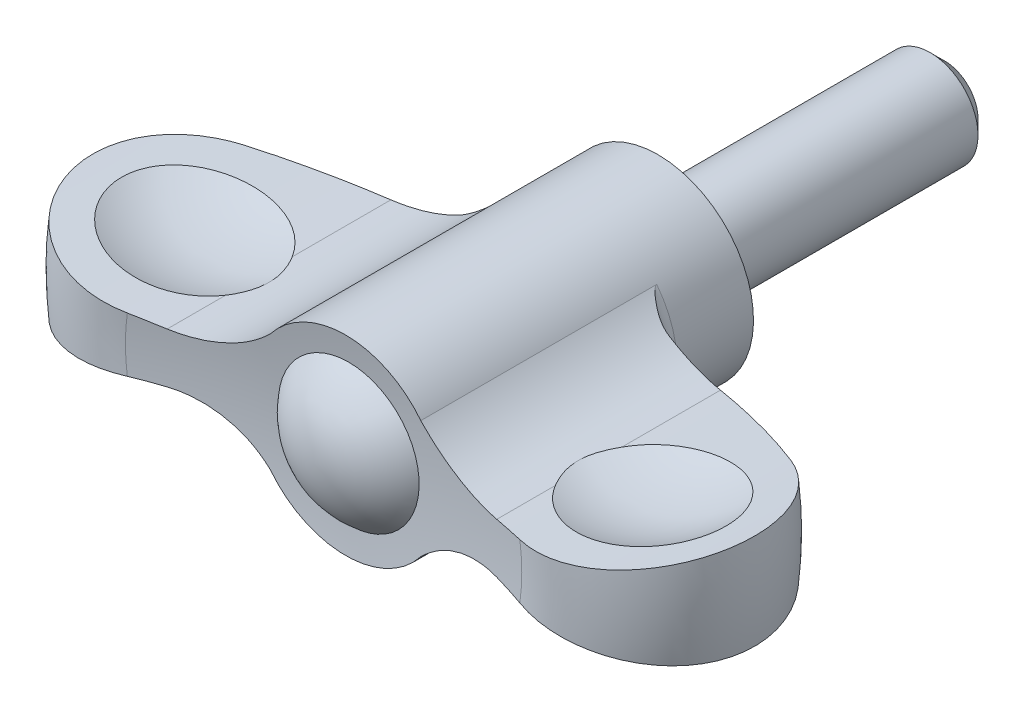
ISO-10303-21;
HEADER;
FILE_DESCRIPTION(('STEP AP214'),'2;1');
FILE_NAME('part.step','',(''),(''),'','','');
FILE_SCHEMA(('AUTOMOTIVE_DESIGN { 1 0 10303 214 1 1 1 1 }'));
ENDSEC;
DATA;
#1=APPLICATION_CONTEXT('core data for automotive mechanical design processes');
#2=APPLICATION_PROTOCOL_DEFINITION('international standard','automotive_design',2000,#1);
#3=PRODUCT_CONTEXT('',#1,'mechanical');
#4=PRODUCT('Part','Part','',(#3));
#5=PRODUCT_RELATED_PRODUCT_CATEGORY('part','',(#4));
#6=PRODUCT_DEFINITION_FORMATION('','',#4);
#7=PRODUCT_DEFINITION_CONTEXT('part definition',#1,'design');
#8=PRODUCT_DEFINITION('design','',#6,#7);
#9=PRODUCT_DEFINITION_SHAPE('','',#8);
#10=(LENGTH_UNIT() NAMED_UNIT(*) SI_UNIT(.MILLI.,.METRE.));
#11=(NAMED_UNIT(*) PLANE_ANGLE_UNIT() SI_UNIT($,.RADIAN.));
#12=(NAMED_UNIT(*) SI_UNIT($,.STERADIAN.) SOLID_ANGLE_UNIT());
#13=UNCERTAINTY_MEASURE_WITH_UNIT(LENGTH_MEASURE(1.E-05),#10,'distance_accuracy_value','');
#14=(GEOMETRIC_REPRESENTATION_CONTEXT(3) GLOBAL_UNCERTAINTY_ASSIGNED_CONTEXT((#13)) GLOBAL_UNIT_ASSIGNED_CONTEXT((#10,
#11,#12)) REPRESENTATION_CONTEXT('',''));
#15=CARTESIAN_POINT('',(0.,0.,0.));
#16=DIRECTION('',(0.,0.,1.));
#17=DIRECTION('',(1.,0.,0.));
#18=AXIS2_PLACEMENT_3D('',#15,#16,#17);
#19=CARTESIAN_POINT('',(0.,0.,8.));
#20=DIRECTION('',(0.,0.,-1.));
#21=DIRECTION('',(0.,1.,0.));
#22=AXIS2_PLACEMENT_3D('',#19,#20,#21);
#23=TOROIDAL_SURFACE('',#22,11.8,1.80000000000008);
#24=CARTESIAN_POINT('',(-10.936400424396,-3.94636818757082,9.7916319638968));
#25=CARTESIAN_POINT('',(-10.824118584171,-4.00370429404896,9.78325234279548));
#26=CARTESIAN_POINT('',(-10.7132133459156,-4.06254400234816,9.76897182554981));
#27=CARTESIAN_POINT('',(-10.4947965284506,-4.18269546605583,9.73031315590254));
#28=CARTESIAN_POINT('',(-10.3872790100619,-4.24400241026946,9.70595387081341));
#29=CARTESIAN_POINT('',(-10.1765147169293,-4.36838152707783,9.6489761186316));
#30=CARTESIAN_POINT('',(-10.0732455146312,-4.43144032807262,9.61641003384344));
#31=CARTESIAN_POINT('',(-9.87034998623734,-4.55941800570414,9.54423053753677));
#32=CARTESIAN_POINT('',(-9.77072514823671,-4.62433762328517,9.50461428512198));
#33=CARTESIAN_POINT('',(-9.55076497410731,-4.77218804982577,9.40879869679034));
#34=CARTESIAN_POINT('',(-9.43146470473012,-4.85557105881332,9.35092807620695));
#35=CARTESIAN_POINT('',(-9.19845422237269,-5.0245357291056,9.22749490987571));
#36=CARTESIAN_POINT('',(-9.08474708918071,-5.11011856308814,9.16192819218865));
#37=CARTESIAN_POINT('',(-8.89583509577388,-5.25740071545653,9.04459290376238));
#38=CARTESIAN_POINT('',(-8.81922141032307,-5.31864764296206,8.99450670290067));
#39=CARTESIAN_POINT('',(-8.66877804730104,-5.44185241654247,8.89113944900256));
#40=CARTESIAN_POINT('',(-8.59494804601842,-5.50381017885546,8.83785876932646));
#41=CARTESIAN_POINT('',(-8.4741799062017,-5.60755853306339,8.74594898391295));
#42=CARTESIAN_POINT('',(-8.42641392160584,-5.64925103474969,8.7082931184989));
#43=CARTESIAN_POINT('',(-8.33242521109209,-5.73256077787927,8.6310972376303));
#44=CARTESIAN_POINT('',(-8.28620142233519,-5.77417805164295,8.59155856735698));
#45=CARTESIAN_POINT('',(-8.21125367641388,-5.84266935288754,8.52388347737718));
#46=CARTESIAN_POINT('',(-8.18198002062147,-5.86968993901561,8.49650386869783));
#47=CARTESIAN_POINT('',(-8.12444979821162,-5.92330159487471,8.44010631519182));
#48=CARTESIAN_POINT('',(-8.09619524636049,-5.94989176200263,8.41108538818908));
#49=CARTESIAN_POINT('',(-8.04234032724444,-6.00103726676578,8.35179046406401));
#50=CARTESIAN_POINT('',(-8.01668026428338,-6.02563150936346,8.32160361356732));
#51=CARTESIAN_POINT('',(-7.96790958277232,-6.07276025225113,8.2576023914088));
#52=CARTESIAN_POINT('',(-7.94479257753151,-6.09529988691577,8.22379754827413));
#53=CARTESIAN_POINT('',(-7.91701322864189,-6.12255630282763,8.17250880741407));
#54=CARTESIAN_POINT('',(-7.90975258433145,-6.12970126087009,8.157793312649));
#55=CARTESIAN_POINT('',(-7.89665438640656,-6.14261741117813,8.12727584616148));
#56=CARTESIAN_POINT('',(-7.89080740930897,-6.14839769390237,8.11148202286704));
#57=CARTESIAN_POINT('',(-7.88158226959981,-6.15753000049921,8.08013275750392));
#58=CARTESIAN_POINT('',(-7.87802903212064,-6.16105398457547,8.06468423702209));
#59=CARTESIAN_POINT('',(-7.87307566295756,-6.16597001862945,8.03281428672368));
#60=CARTESIAN_POINT('',(-7.87172008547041,-6.16731795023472,8.01637956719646));
#61=CARTESIAN_POINT('',(-7.8717856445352,-6.16725149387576,7.9998));
#62=B_SPLINE_CURVE_WITH_KNOTS('',3,(#24,#25,#26,#27,#28,#29,#30,#31,#32,#33,#34,#35,#36,#37,#38,
#39,#40,#41,#42,#43,#44,#45,#46,#47,#48,#49,#50,#51,#52,#53,#54,#55,#56,#57,#58,#59,#60,#61),
.UNSPECIFIED.,.F.,.F.,(4,2,2,2,2,2,2,2,2,2,2,2,2,2,2,2,2,2,4),(0.,0.378686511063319,
0.756667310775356,1.13229407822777,1.50807255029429,1.97761636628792,2.44741590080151,
2.77774393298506,3.10803343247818,3.32923096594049,3.55027276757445,3.6952714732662,
3.84054267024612,3.98039395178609,4.11988557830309,4.17347981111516,4.22670627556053,
4.27513325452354,4.32453026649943),.UNSPECIFIED.);
#63=CARTESIAN_POINT('',(-10.9337221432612,-3.94773654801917,9.7914319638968));
#64=VERTEX_POINT('',#63);
#65=CARTESIAN_POINT('',(-7.8717855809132,-6.16725155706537,8.));
#66=VERTEX_POINT('',#65);
#67=EDGE_CURVE('E416',#64,#66,#62,.T.);
#68=ORIENTED_EDGE('',*,*,#67,.F.);
#69=CARTESIAN_POINT('',(0.,0.,9.7914319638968));
#70=DIRECTION('',(0.,0.,-1.));
#71=DIRECTION('',(0.,1.,0.));
#72=AXIS2_PLACEMENT_3D('',#69,#70,#71);
#73=CIRCLE('',#72,11.6245818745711);
#74=CARTESIAN_POINT('',(-10.9337221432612,3.94773654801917,9.7914319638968));
#75=VERTEX_POINT('',#74);
#76=EDGE_CURVE('E418',#64,#75,#73,.T.);
#77=ORIENTED_EDGE('',*,*,#76,.T.);
#78=CARTESIAN_POINT('',(-10.936400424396,3.94636818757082,9.7916319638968));
#79=CARTESIAN_POINT('',(-10.824118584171,4.00370429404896,9.78325234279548));
#80=CARTESIAN_POINT('',(-10.7132133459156,4.06254400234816,9.76897182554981));
#81=CARTESIAN_POINT('',(-10.4947965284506,4.18269546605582,9.73031315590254));
#82=CARTESIAN_POINT('',(-10.3872790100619,4.24400241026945,9.70595387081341));
#83=CARTESIAN_POINT('',(-10.1765147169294,4.36838152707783,9.64897611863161));
#84=CARTESIAN_POINT('',(-10.0732455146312,4.43144032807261,9.61641003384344));
#85=CARTESIAN_POINT('',(-9.87034998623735,4.55941800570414,9.54423053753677));
#86=CARTESIAN_POINT('',(-9.77072514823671,4.62433762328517,9.50461428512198));
#87=CARTESIAN_POINT('',(-9.55076497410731,4.77218804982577,9.40879869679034));
#88=CARTESIAN_POINT('',(-9.43146470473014,4.85557105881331,9.35092807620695));
#89=CARTESIAN_POINT('',(-9.1984542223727,5.02453572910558,9.22749490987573));
#90=CARTESIAN_POINT('',(-9.0847470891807,5.11011856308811,9.1619281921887));
#91=CARTESIAN_POINT('',(-8.89583509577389,5.25740071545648,9.04459290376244));
#92=CARTESIAN_POINT('',(-8.8192214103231,5.318647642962,8.99450670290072));
#93=CARTESIAN_POINT('',(-8.66877804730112,5.44185241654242,8.89113944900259));
#94=CARTESIAN_POINT('',(-8.59494804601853,5.50381017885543,8.8378587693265));
#95=CARTESIAN_POINT('',(-8.47417990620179,5.60755853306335,8.74594898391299));
#96=CARTESIAN_POINT('',(-8.4264139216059,5.64925103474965,8.70829311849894));
#97=CARTESIAN_POINT('',(-8.33242521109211,5.73256077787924,8.63109723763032));
#98=CARTESIAN_POINT('',(-8.2862014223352,5.77417805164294,8.59155856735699));
#99=CARTESIAN_POINT('',(-8.21125367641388,5.84266935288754,8.52388347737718));
#100=CARTESIAN_POINT('',(-8.18198002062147,5.86968993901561,8.49650386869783));
#101=CARTESIAN_POINT('',(-8.12444979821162,5.92330159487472,8.44010631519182));
#102=CARTESIAN_POINT('',(-8.09619524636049,5.94989176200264,8.41108538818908));
#103=CARTESIAN_POINT('',(-8.04234032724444,6.00103726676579,8.35179046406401));
#104=CARTESIAN_POINT('',(-8.01668026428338,6.02563150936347,8.32160361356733));
#105=CARTESIAN_POINT('',(-7.96790958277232,6.07276025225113,8.2576023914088));
#106=CARTESIAN_POINT('',(-7.94479257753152,6.09529988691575,8.22379754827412));
#107=CARTESIAN_POINT('',(-7.91701322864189,6.12255630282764,8.17250880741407));
#108=CARTESIAN_POINT('',(-7.90975258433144,6.1297012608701,8.15779331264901));
#109=CARTESIAN_POINT('',(-7.89665438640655,6.14261741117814,8.12727584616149));
#110=CARTESIAN_POINT('',(-7.89080740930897,6.14839769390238,8.11148202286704));
#111=CARTESIAN_POINT('',(-7.88158226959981,6.1575300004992,8.08013275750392));
#112=CARTESIAN_POINT('',(-7.87802903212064,6.16105398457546,8.06468423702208));
#113=CARTESIAN_POINT('',(-7.87307566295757,6.16597001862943,8.03281428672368));
#114=CARTESIAN_POINT('',(-7.87172008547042,6.16731795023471,8.01637956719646));
#115=CARTESIAN_POINT('',(-7.8717856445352,6.16725149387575,7.9998));
#116=B_SPLINE_CURVE_WITH_KNOTS('',3,(#78,#79,#80,#81,#82,#83,#84,#85,#86,#87,#88,#89,#90,#91,
#92,#93,#94,#95,#96,#97,#98,#99,#100,#101,#102,#103,#104,#105,#106,#107,#108,#109,#110,#111,
#112,#113,#114,#115),.UNSPECIFIED.,.F.,.F.,(4,2,2,2,2,2,2,2,2,2,2,2,2,2,2,2,2,2,4),(0.,
0.378686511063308,0.756667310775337,1.13229407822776,1.50807255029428,1.97761636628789,
2.44741590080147,2.77774393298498,3.10803343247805,3.32923096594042,3.55027276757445,
3.6952714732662,3.84054267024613,3.98039395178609,4.11988557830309,4.17347981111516,
4.22670627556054,4.27513325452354,4.32453026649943),.UNSPECIFIED.);
#117=CARTESIAN_POINT('',(-7.8717855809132,6.16725155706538,8.));
#118=VERTEX_POINT('',#117);
#119=EDGE_CURVE('E317',#75,#118,#116,.T.);
#120=ORIENTED_EDGE('',*,*,#119,.T.);
#121=CARTESIAN_POINT('',(0.,0.,8.));
#122=DIRECTION('',(0.,0.,-1.));
#123=DIRECTION('',(0.,1.,0.));
#124=AXIS2_PLACEMENT_3D('',#121,#122,#123);
#125=CIRCLE('',#124,10.);
#126=EDGE_CURVE('E420',#66,#118,#125,.T.);
#127=ORIENTED_EDGE('',*,*,#126,.F.);
#128=EDGE_LOOP('',(#68,#77,#120,#127));
#129=FACE_BOUND('',#128,.T.);
#130=ADVANCED_FACE('F14',(#129),#23,.F.);
#131=CARTESIAN_POINT('',(0.,0.,60.3122983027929));
#132=DIRECTION('',(0.,0.,-1.));
#133=DIRECTION('',(0.,1.,0.));
#134=AXIS2_PLACEMENT_3D('',#131,#132,#133);
#135=DEGENERATE_TOROIDAL_SURFACE('',#134,6.6775474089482,50.7624968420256,.T.);
#136=ORIENTED_EDGE('',*,*,#76,.F.);
#137=CARTESIAN_POINT('',(-6.5467060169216,-7.72330133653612,9.66697769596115));
#138=CARTESIAN_POINT('',(-6.64591288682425,-7.58492422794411,9.66416255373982));
#139=CARTESIAN_POINT('',(-6.74799440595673,-7.44862247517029,9.661900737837));
#140=CARTESIAN_POINT('',(-6.95774811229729,-7.18037757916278,9.65844214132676));
#141=CARTESIAN_POINT('',(-7.06542027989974,-7.04843442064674,9.6572453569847));
#142=CARTESIAN_POINT('',(-7.39653737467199,-6.6595102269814,9.65519040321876));
#143=CARTESIAN_POINT('',(-7.62812663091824,-6.40937348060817,9.65586643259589));
#144=CARTESIAN_POINT('',(-8.11129299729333,-5.92925394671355,9.66138002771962));
#145=CARTESIAN_POINT('',(-8.36287299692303,-5.69927408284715,9.66621819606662));
#146=CARTESIAN_POINT('',(-8.88421895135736,-5.26109545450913,9.68055080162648));
#147=CARTESIAN_POINT('',(-9.15398440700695,-5.05289609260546,9.69004511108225));
#148=CARTESIAN_POINT('',(-9.70731186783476,-4.66146851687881,9.71434109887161));
#149=CARTESIAN_POINT('',(-9.99073342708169,-4.47803881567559,9.72909588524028));
#150=CARTESIAN_POINT('',(-10.5714417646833,-4.13530031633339,9.76473262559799));
#151=CARTESIAN_POINT('',(-10.8687285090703,-3.97599145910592,9.78561456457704));
#152=CARTESIAN_POINT('',(-11.4746831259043,-3.68269992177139,9.83420440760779));
#153=CARTESIAN_POINT('',(-11.7833407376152,-3.54869504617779,9.86190627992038));
#154=CARTESIAN_POINT('',(-12.4099583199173,-3.30668939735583,9.92468529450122));
#155=CARTESIAN_POINT('',(-12.72791823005,-3.19868845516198,9.95976238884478));
#156=CARTESIAN_POINT('',(-13.3702784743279,-3.00943594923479,10.0375625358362));
#157=CARTESIAN_POINT('',(-13.694668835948,-2.92814595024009,10.080274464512));
#158=CARTESIAN_POINT('',(-14.3479208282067,-2.7924555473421,10.173495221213));
#159=CARTESIAN_POINT('',(-14.6767824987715,-2.73805538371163,10.2240041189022));
#160=CARTESIAN_POINT('',(-15.3369192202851,-2.65620760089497,10.3328061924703));
#161=CARTESIAN_POINT('',(-15.6681964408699,-2.62878831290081,10.3911074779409));
#162=CARTESIAN_POINT('',(-16.3304789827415,-2.60086726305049,10.5152293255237));
#163=CARTESIAN_POINT('',(-16.6614842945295,-2.60036640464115,10.5810501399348));
#164=CARTESIAN_POINT('',(-17.3240428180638,-2.62605289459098,10.7205107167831));
#165=CARTESIAN_POINT('',(-17.6555720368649,-2.65249066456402,10.7942180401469));
#166=CARTESIAN_POINT('',(-18.3138495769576,-2.73187573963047,10.9484805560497));
#167=CARTESIAN_POINT('',(-18.6405974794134,-2.78482535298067,11.0290363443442));
#168=CARTESIAN_POINT('',(-19.2867879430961,-2.91642655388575,11.1963521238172));
#169=CARTESIAN_POINT('',(-19.6062391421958,-2.99504586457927,11.2831042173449));
#170=CARTESIAN_POINT('',(-20.2362844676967,-3.17708996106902,11.4622866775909));
#171=CARTESIAN_POINT('',(-20.5468805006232,-3.28050936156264,11.5547158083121));
#172=CARTESIAN_POINT('',(-20.8521318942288,-3.39588894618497,11.6496949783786));
#173=B_SPLINE_CURVE_WITH_KNOTS('',3,(#137,#138,#139,#140,#141,#142,#143,#144,#145,#146,#147,
#148,#149,#150,#151,#152,#153,#154,#155,#156,#157,#158,#159,#160,#161,#162,#163,#164,#165,#166,
#167,#168,#169,#170,#171,#172),.UNSPECIFIED.,.F.,.F.,(4,2,2,2,2,2,2,2,2,2,2,2,2,2,2,2,2,4),(0.,
0.510785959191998,1.02157012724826,2.04291399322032,3.06440575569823,4.08586949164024,
5.09844663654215,6.11102130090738,7.12270361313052,8.13437935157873,9.14459291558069,
10.1548155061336,11.1660977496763,12.1774139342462,13.1982178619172,14.2191106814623,
15.2387247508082,16.2581176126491),.UNSPECIFIED.);
#174=CARTESIAN_POINT('',(-17.2513916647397,-2.62600423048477,10.7060191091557));
#175=VERTEX_POINT('',#174);
#176=EDGE_CURVE('E424',#64,#175,#173,.T.);
#177=ORIENTED_EDGE('',*,*,#176,.T.);
#178=CARTESIAN_POINT('',(-28.5420587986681,-3.86093353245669,14.6248916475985));
#179=CARTESIAN_POINT('',(-28.0949251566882,-3.78973654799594,14.4056959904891));
#180=CARTESIAN_POINT('',(-27.6441940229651,-3.72065339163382,14.1932196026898));
#181=CARTESIAN_POINT('',(-26.7359054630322,-3.58698745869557,13.7818878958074));
#182=CARTESIAN_POINT('',(-26.2783480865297,-3.52240464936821,13.583032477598));
#183=CARTESIAN_POINT('',(-24.8998297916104,-3.33633398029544,13.0087706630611));
#184=CARTESIAN_POINT('',(-23.9692804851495,-3.22192463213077,12.6538347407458));
#185=CARTESIAN_POINT('',(-22.0863023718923,-3.01405683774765,12.0002442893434));
#186=CARTESIAN_POINT('',(-21.133873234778,-2.92059870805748,11.701590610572));
#187=CARTESIAN_POINT('',(-19.6898454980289,-2.79722984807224,11.296179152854));
#188=CARTESIAN_POINT('',(-19.2049108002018,-2.75884755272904,11.1679139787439));
#189=CARTESIAN_POINT('',(-18.2309836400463,-2.68796520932,10.9259763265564));
#190=CARTESIAN_POINT('',(-17.7419911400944,-2.65546521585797,10.8123039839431));
#191=CARTESIAN_POINT('',(-17.2511916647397,-2.6259922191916,10.7059757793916));
#192=B_SPLINE_CURVE_WITH_KNOTS('',3,(#178,#179,#180,#181,#182,#183,#184,#185,#186,#187,#188,
#189,#190,#191),.UNSPECIFIED.,.F.,.F.,(4,2,2,2,2,2,4),(0.,1.50898291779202,3.01795485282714,
6.0232908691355,9.02867228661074,10.5376740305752,12.0466897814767),.UNSPECIFIED.);
#193=CARTESIAN_POINT('',(-28.5416508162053,-3.86086857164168,14.6246916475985));
#194=VERTEX_POINT('',#193);
#195=EDGE_CURVE('E506',#194,#175,#192,.T.);
#196=ORIENTED_EDGE('',*,*,#195,.F.);
#197=CARTESIAN_POINT('',(0.,0.,14.6246916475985));
#198=DIRECTION('',(0.,0.,-1.));
#199=DIRECTION('',(0.,1.,0.));
#200=AXIS2_PLACEMENT_3D('',#197,#198,#199);
#201=CIRCLE('',#200,28.8015995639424);
#202=CARTESIAN_POINT('',(-28.5416508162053,3.86086857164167,14.6246916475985));
#203=VERTEX_POINT('',#202);
#204=EDGE_CURVE('E434',#194,#203,#201,.T.);
#205=ORIENTED_EDGE('',*,*,#204,.T.);
#206=CARTESIAN_POINT('',(-28.542058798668,3.86093353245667,14.6248916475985));
#207=CARTESIAN_POINT('',(-28.0949251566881,3.78973654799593,14.4056959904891));
#208=CARTESIAN_POINT('',(-27.644194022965,3.7206533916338,14.1932196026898));
#209=CARTESIAN_POINT('',(-26.7359054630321,3.58698745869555,13.7818878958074));
#210=CARTESIAN_POINT('',(-26.2783480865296,3.52240464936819,13.583032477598));
#211=CARTESIAN_POINT('',(-24.8998297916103,3.33633398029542,13.0087706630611));
#212=CARTESIAN_POINT('',(-23.9692804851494,3.22192463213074,12.6538347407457));
#213=CARTESIAN_POINT('',(-22.0863023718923,3.01405683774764,12.0002442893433));
#214=CARTESIAN_POINT('',(-21.133873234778,2.92059870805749,11.701590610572));
#215=CARTESIAN_POINT('',(-19.6898454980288,2.79722984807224,11.296179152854));
#216=CARTESIAN_POINT('',(-19.2049108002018,2.75884755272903,11.1679139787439));
#217=CARTESIAN_POINT('',(-18.2309836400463,2.68796520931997,10.9259763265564));
#218=CARTESIAN_POINT('',(-17.7419911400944,2.65546521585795,10.8123039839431));
#219=CARTESIAN_POINT('',(-17.2511916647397,2.6259922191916,10.7059757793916));
#220=B_SPLINE_CURVE_WITH_KNOTS('',3,(#206,#207,#208,#209,#210,#211,#212,#213,#214,#215,#216,
#217,#218,#219),.UNSPECIFIED.,.F.,.F.,(4,2,2,2,2,2,4),(0.,1.50898291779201,3.01795485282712,
6.02329086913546,9.02867228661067,10.5376740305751,12.0466897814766),.UNSPECIFIED.);
#221=CARTESIAN_POINT('',(-17.2513916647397,2.62600423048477,10.7060191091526));
#222=VERTEX_POINT('',#221);
#223=EDGE_CURVE('E331',#203,#222,#220,.T.);
#224=ORIENTED_EDGE('',*,*,#223,.T.);
#225=CARTESIAN_POINT('',(-6.5467060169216,7.72330133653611,9.66697769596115));
#226=CARTESIAN_POINT('',(-6.64591288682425,7.5849242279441,9.66416255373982));
#227=CARTESIAN_POINT('',(-6.74799440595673,7.44862247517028,9.661900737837));
#228=CARTESIAN_POINT('',(-6.9577481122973,7.18037757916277,9.65844214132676));
#229=CARTESIAN_POINT('',(-7.06542027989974,7.04843442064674,9.6572453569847));
#230=CARTESIAN_POINT('',(-7.39653737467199,6.65951022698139,9.65519040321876));
#231=CARTESIAN_POINT('',(-7.62812663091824,6.40937348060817,9.65586643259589));
#232=CARTESIAN_POINT('',(-8.11129299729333,5.92925394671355,9.66138002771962));
#233=CARTESIAN_POINT('',(-8.36287299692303,5.69927408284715,9.66621819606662));
#234=CARTESIAN_POINT('',(-8.88421895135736,5.26109545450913,9.68055080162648));
#235=CARTESIAN_POINT('',(-9.15398440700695,5.05289609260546,9.69004511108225));
#236=CARTESIAN_POINT('',(-9.70731186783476,4.66146851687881,9.71434109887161));
#237=CARTESIAN_POINT('',(-9.99073342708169,4.47803881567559,9.72909588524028));
#238=CARTESIAN_POINT('',(-10.5714417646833,4.13530031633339,9.76473262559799));
#239=CARTESIAN_POINT('',(-10.8687285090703,3.97599145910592,9.78561456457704));
#240=CARTESIAN_POINT('',(-11.4746831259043,3.68269992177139,9.83420440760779));
#241=CARTESIAN_POINT('',(-11.7833407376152,3.54869504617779,9.86190627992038));
#242=CARTESIAN_POINT('',(-12.4099583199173,3.30668939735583,9.92468529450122));
#243=CARTESIAN_POINT('',(-12.72791823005,3.19868845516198,9.95976238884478));
#244=CARTESIAN_POINT('',(-13.3702784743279,3.00943594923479,10.0375625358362));
#245=CARTESIAN_POINT('',(-13.694668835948,2.92814595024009,10.080274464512));
#246=CARTESIAN_POINT('',(-14.3479208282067,2.7924555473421,10.173495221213));
#247=CARTESIAN_POINT('',(-14.6767824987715,2.73805538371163,10.2240041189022));
#248=CARTESIAN_POINT('',(-15.3369192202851,2.65620760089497,10.3328061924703));
#249=CARTESIAN_POINT('',(-15.6681964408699,2.62878831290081,10.3911074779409));
#250=CARTESIAN_POINT('',(-16.3304789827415,2.60086726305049,10.5152293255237));
#251=CARTESIAN_POINT('',(-16.6614842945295,2.60036640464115,10.5810501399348));
#252=CARTESIAN_POINT('',(-17.3240428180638,2.62605289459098,10.7205107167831));
#253=CARTESIAN_POINT('',(-17.6555720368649,2.65249066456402,10.7942180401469));
#254=CARTESIAN_POINT('',(-18.3138495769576,2.73187573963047,10.9484805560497));
#255=CARTESIAN_POINT('',(-18.6405974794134,2.78482535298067,11.0290363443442));
#256=CARTESIAN_POINT('',(-19.2867879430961,2.91642655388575,11.1963521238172));
#257=CARTESIAN_POINT('',(-19.6062391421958,2.99504586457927,11.2831042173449));
#258=CARTESIAN_POINT('',(-20.2362844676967,3.17708996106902,11.4622866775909));
#259=CARTESIAN_POINT('',(-20.5468805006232,3.28050936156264,11.5547158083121));
#260=CARTESIAN_POINT('',(-20.8521318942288,3.39588894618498,11.6496949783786));
#261=B_SPLINE_CURVE_WITH_KNOTS('',3,(#225,#226,#227,#228,#229,#230,#231,#232,#233,#234,#235,
#236,#237,#238,#239,#240,#241,#242,#243,#244,#245,#246,#247,#248,#249,#250,#251,#252,#253,#254,
#255,#256,#257,#258,#259,#260),.UNSPECIFIED.,.F.,.F.,(4,2,2,2,2,2,2,2,2,2,2,2,2,2,2,2,2,4),(0.,
0.510785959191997,1.02157012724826,2.04291399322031,3.06440575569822,4.08586949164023,
5.09844663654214,6.11102130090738,7.12270361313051,8.13437935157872,9.14459291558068,
10.1548155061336,11.1660977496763,12.1774139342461,13.1982178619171,14.2191106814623,
15.2387247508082,16.2581176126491),.UNSPECIFIED.);
#262=EDGE_CURVE('E300',#75,#222,#261,.T.);
#263=ORIENTED_EDGE('',*,*,#262,.F.);
#264=EDGE_LOOP('',(#136,#177,#196,#205,#224,#263));
#265=FACE_BOUND('',#264,.T.);
#266=ADVANCED_FACE('F406',(#265),#135,.T.);
#267=CARTESIAN_POINT('',(0.,0.,24.5131504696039));
#268=DIRECTION('',(0.,0.,-1.));
#269=DIRECTION('',(0.,1.,0.));
#270=AXIS2_PLACEMENT_3D('',#267,#268,#269);
#271=TOROIDAL_SURFACE('',#270,24.0131504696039,10.9868495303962);
#272=CARTESIAN_POINT('',(-17.2511916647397,-2.62599221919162,33.3242100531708));
#273=CARTESIAN_POINT('',(-17.4993781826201,-2.64089075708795,33.5086851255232));
#274=CARTESIAN_POINT('',(-17.7552628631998,-2.65706460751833,33.6826969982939));
#275=CARTESIAN_POINT('',(-18.28053769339,-2.69210530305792,34.0086627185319));
#276=CARTESIAN_POINT('',(-18.5499277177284,-2.71097212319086,34.1606167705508));
#277=CARTESIAN_POINT('',(-19.1002002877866,-2.75153205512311,34.4412740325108));
#278=CARTESIAN_POINT('',(-19.381077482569,-2.77322386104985,34.5699879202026));
#279=CARTESIAN_POINT('',(-19.952432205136,-2.81952002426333,34.8033129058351));
#280=CARTESIAN_POINT('',(-20.2429095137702,-2.84412431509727,34.9079245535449));
#281=CARTESIAN_POINT('',(-20.8315983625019,-2.89628797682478,35.0923323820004));
#282=CARTESIAN_POINT('',(-21.1298150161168,-2.92384934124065,35.1721116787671));
#283=CARTESIAN_POINT('',(-21.7316508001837,-2.98187199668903,35.3061577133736));
#284=CARTESIAN_POINT('',(-22.035269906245,-3.01233327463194,35.3604245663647));
#285=CARTESIAN_POINT('',(-22.6456357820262,-3.0760359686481,35.4430189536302));
#286=CARTESIAN_POINT('',(-22.9523815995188,-3.10927655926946,35.4713541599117));
#287=CARTESIAN_POINT('',(-23.566877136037,-3.17836345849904,35.501889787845));
#288=CARTESIAN_POINT('',(-23.874626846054,-3.21420974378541,35.504090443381));
#289=CARTESIAN_POINT('',(-24.4874432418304,-3.28807700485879,35.4823817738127));
#290=CARTESIAN_POINT('',(-24.7925157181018,-3.32608674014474,35.4585974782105));
#291=CARTESIAN_POINT('',(-25.3992908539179,-3.404117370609,35.3852808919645));
#292=CARTESIAN_POINT('',(-25.7009935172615,-3.44413826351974,35.3357486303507));
#293=CARTESIAN_POINT('',(-26.2989412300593,-3.52581537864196,35.211278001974));
#294=CARTESIAN_POINT('',(-26.595185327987,-3.56747188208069,35.1363352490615));
#295=CARTESIAN_POINT('',(-27.1800717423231,-3.65197221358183,34.9615826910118));
#296=CARTESIAN_POINT('',(-27.4687140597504,-3.69481604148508,34.8617728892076));
#297=CARTESIAN_POINT('',(-28.035952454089,-3.78113479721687,34.6381665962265));
#298=CARTESIAN_POINT('',(-28.3145627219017,-3.82460870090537,34.514405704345));
#299=CARTESIAN_POINT('',(-28.8602471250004,-3.9117173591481,34.2436848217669));
#300=CARTESIAN_POINT('',(-29.1273212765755,-3.9553521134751,34.0967248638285));
#301=CARTESIAN_POINT('',(-29.6480727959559,-4.04221651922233,33.7806574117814));
#302=CARTESIAN_POINT('',(-29.9017509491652,-4.08544619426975,33.6115512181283));
#303=CARTESIAN_POINT('',(-30.3939845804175,-4.17091924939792,33.2523788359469));
#304=CARTESIAN_POINT('',(-30.6325400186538,-4.21316262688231,33.0623125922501));
#305=CARTESIAN_POINT('',(-31.0935716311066,-4.29619199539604,32.6619711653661));
#306=CARTESIAN_POINT('',(-31.3159985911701,-4.33697334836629,32.4516383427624));
#307=CARTESIAN_POINT('',(-31.7424740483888,-4.41635307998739,32.0127202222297));
#308=CARTESIAN_POINT('',(-31.9465225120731,-4.45495145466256,31.7841348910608));
#309=CARTESIAN_POINT('',(-32.3348520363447,-4.5293877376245,31.3103146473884));
#310=CARTESIAN_POINT('',(-32.5191323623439,-4.56522554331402,31.0650791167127));
#311=CARTESIAN_POINT('',(-32.8666572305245,-4.63358841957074,30.5596945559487));
#312=CARTESIAN_POINT('',(-33.0299017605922,-4.66611348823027,30.2995455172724));
#313=CARTESIAN_POINT('',(-33.3345075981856,-4.72739462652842,29.7656976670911));
#314=CARTESIAN_POINT('',(-33.4758297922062,-4.75614394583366,29.4919757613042));
#315=CARTESIAN_POINT('',(-33.7352733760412,-4.80934524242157,28.9333467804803));
#316=CARTESIAN_POINT('',(-33.8533947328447,-4.83379721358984,28.6484396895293));
#317=CARTESIAN_POINT('',(-34.0656204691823,-4.87800530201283,28.0694731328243));
#318=CARTESIAN_POINT('',(-34.1597255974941,-4.89776156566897,27.7754139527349));
#319=CARTESIAN_POINT('',(-34.3232748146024,-4.93225390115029,27.180228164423));
#320=CARTESIAN_POINT('',(-34.3927189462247,-4.94698998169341,26.8791015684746));
#321=CARTESIAN_POINT('',(-34.5063857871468,-4.97117989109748,26.2723608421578));
#322=CARTESIAN_POINT('',(-34.5506442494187,-4.98064120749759,25.96675370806));
#323=CARTESIAN_POINT('',(-34.6137870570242,-4.99415603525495,25.3528106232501));
#324=CARTESIAN_POINT('',(-34.6326714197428,-4.99820955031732,25.0444746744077));
#325=CARTESIAN_POINT('',(-34.644935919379,-5.00084099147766,24.4272603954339));
#326=CARTESIAN_POINT('',(-34.6383150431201,-4.99941870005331,24.1183820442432));
#327=CARTESIAN_POINT('',(-34.5996125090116,-4.9911218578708,23.5022985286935));
#328=CARTESIAN_POINT('',(-34.5675308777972,-4.9842473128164,23.1950933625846));
#329=CARTESIAN_POINT('',(-34.4781950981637,-4.96517513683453,22.5850017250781));
#330=CARTESIAN_POINT('',(-34.4209785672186,-4.95298546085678,22.2821094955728));
#331=CARTESIAN_POINT('',(-34.2817747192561,-4.92348679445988,21.6823260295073));
#332=CARTESIAN_POINT('',(-34.1997873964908,-4.90617780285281,21.3854347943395));
#333=CARTESIAN_POINT('',(-34.0116119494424,-4.86672680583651,20.799780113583));
#334=CARTESIAN_POINT('',(-33.9054257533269,-4.84458518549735,20.5110160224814));
#335=CARTESIAN_POINT('',(-33.6695763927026,-4.79582854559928,19.9436331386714));
#336=CARTESIAN_POINT('',(-33.5399133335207,-4.76921354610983,19.6650143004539));
#337=CARTESIAN_POINT('',(-33.2578321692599,-4.71190410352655,19.1195687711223));
#338=CARTESIAN_POINT('',(-33.1053878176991,-4.68120495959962,18.8527561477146));
#339=CARTESIAN_POINT('',(-32.7788934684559,-4.61623623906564,18.3331441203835));
#340=CARTESIAN_POINT('',(-32.6048429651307,-4.58196657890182,18.0803450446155));
#341=CARTESIAN_POINT('',(-32.2363296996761,-4.51038975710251,17.5905487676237));
#342=CARTESIAN_POINT('',(-32.0418667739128,-4.47308257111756,17.3535516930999));
#343=CARTESIAN_POINT('',(-31.633867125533,-4.39599896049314,16.8970435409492));
#344=CARTESIAN_POINT('',(-31.4203320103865,-4.35622274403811,16.6775309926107));
#345=CARTESIAN_POINT('',(-31.0011481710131,-4.27945832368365,16.2816097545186));
#346=CARTESIAN_POINT('',(-30.797399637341,-4.24267293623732,16.103144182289));
#347=CARTESIAN_POINT('',(-30.377205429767,-4.16804353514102,15.7621159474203));
#348=CARTESIAN_POINT('',(-30.1607608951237,-4.13019961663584,15.5995518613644));
#349=CARTESIAN_POINT('',(-29.7163820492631,-4.05387450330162,15.2912603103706));
#350=CARTESIAN_POINT('',(-29.4884504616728,-4.01539346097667,15.1455288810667));
#351=CARTESIAN_POINT('',(-29.0222683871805,-3.9381829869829,14.871631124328));
#352=CARTESIAN_POINT('',(-28.7840165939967,-3.89945352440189,14.7434670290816));
#353=CARTESIAN_POINT('',(-28.5412428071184,-3.86080360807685,14.6244916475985));
#354=B_SPLINE_CURVE_WITH_KNOTS('',3,(#272,#273,#274,#275,#276,#277,#278,#279,#280,#281,#282,
#283,#284,#285,#286,#287,#288,#289,#290,#291,#292,#293,#294,#295,#296,#297,#298,#299,#300,#301,
#302,#303,#304,#305,#306,#307,#308,#309,#310,#311,#312,#313,#314,#315,#316,#317,#318,#319,#320,
#321,#322,#323,#324,#325,#326,#327,#328,#329,#330,#331,#332,#333,#334,#335,#336,#337,#338,#339,
#340,#341,#342,#343,#344,#345,#346,#347,#348,#349,#350,#351,#352,#353),.UNSPECIFIED.,.F.,.F.,(4,
2,2,2,2,2,2,2,2,2,2,2,2,2,2,2,2,2,2,2,2,2,2,2,2,2,2,2,2,2,2,2,2,2,2,2,2,2,2,2,4),(0.,
0.928513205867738,1.85701780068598,2.7850947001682,3.7131504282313,4.64183578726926,
5.57051695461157,6.49892327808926,7.42732129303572,8.35127181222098,9.27522128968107,
10.1993303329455,11.1234392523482,12.0461850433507,12.9689295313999,13.8916198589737,
14.8143126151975,15.7397117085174,16.6651124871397,17.5905476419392,18.5159833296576,
19.4430516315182,20.3701212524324,21.2971619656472,22.2242010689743,23.1499208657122,
24.0756400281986,25.0013959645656,25.9271509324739,26.8515250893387,27.7758994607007,
28.7002002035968,29.6244967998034,30.5498666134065,31.4752580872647,32.4006569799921,
33.3259779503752,34.1452666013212,34.9644818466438,35.7835037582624,36.6026296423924),.UNSPECIFIED.);
#355=CARTESIAN_POINT('',(-20.5453214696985,-2.87092129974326,35.0026521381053));
#356=VERTEX_POINT('',#355);
#357=EDGE_CURVE('E497',#356,#194,#354,.T.);
#358=ORIENTED_EDGE('',*,*,#357,.F.);
#359=CARTESIAN_POINT('',(0.,0.,35.0026521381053));
#360=DIRECTION('',(0.,0.,-1.));
#361=DIRECTION('',(0.,1.,0.));
#362=AXIS2_PLACEMENT_3D('',#359,#360,#361);
#363=CIRCLE('',#362,20.7449372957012);
#364=CARTESIAN_POINT('',(-20.5453214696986,2.87092129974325,35.0026521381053));
#365=VERTEX_POINT('',#364);
#366=EDGE_CURVE('E487',#356,#365,#363,.T.);
#367=ORIENTED_EDGE('',*,*,#366,.T.);
#368=CARTESIAN_POINT('',(-17.2511916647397,2.6259922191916,33.3242100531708));
#369=CARTESIAN_POINT('',(-17.4993781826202,2.64089075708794,33.5086851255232));
#370=CARTESIAN_POINT('',(-17.7552628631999,2.65706460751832,33.6826969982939));
#371=CARTESIAN_POINT('',(-18.28053769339,2.69210530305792,34.0086627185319));
#372=CARTESIAN_POINT('',(-18.5499277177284,2.71097212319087,34.1606167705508));
#373=CARTESIAN_POINT('',(-19.1002002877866,2.75153205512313,34.4412740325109));
#374=CARTESIAN_POINT('',(-19.3810774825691,2.77322386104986,34.5699879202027));
#375=CARTESIAN_POINT('',(-19.952432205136,2.81952002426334,34.8033129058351));
#376=CARTESIAN_POINT('',(-20.2429095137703,2.84412431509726,34.9079245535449));
#377=CARTESIAN_POINT('',(-20.831598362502,2.89628797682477,35.0923323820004));
#378=CARTESIAN_POINT('',(-21.1298150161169,2.92384934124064,35.1721116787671));
#379=CARTESIAN_POINT('',(-21.7316508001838,2.98187199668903,35.3061577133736));
#380=CARTESIAN_POINT('',(-22.0352699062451,3.01233327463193,35.3604245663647));
#381=CARTESIAN_POINT('',(-22.6456357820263,3.0760359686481,35.4430189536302));
#382=CARTESIAN_POINT('',(-22.9523815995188,3.10927655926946,35.4713541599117));
#383=CARTESIAN_POINT('',(-23.566877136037,3.17836345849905,35.501889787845));
#384=CARTESIAN_POINT('',(-23.874626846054,3.21420974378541,35.504090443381));
#385=CARTESIAN_POINT('',(-24.4874432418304,3.28807700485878,35.4823817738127));
#386=CARTESIAN_POINT('',(-24.7925157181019,3.32608674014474,35.4585974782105));
#387=CARTESIAN_POINT('',(-25.3992908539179,3.404117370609,35.3852808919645));
#388=CARTESIAN_POINT('',(-25.7009935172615,3.44413826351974,35.3357486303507));
#389=CARTESIAN_POINT('',(-26.2989412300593,3.52581537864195,35.211278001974));
#390=CARTESIAN_POINT('',(-26.595185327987,3.56747188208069,35.1363352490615));
#391=CARTESIAN_POINT('',(-27.1800717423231,3.65197221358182,34.9615826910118));
#392=CARTESIAN_POINT('',(-27.4687140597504,3.69481604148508,34.8617728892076));
#393=CARTESIAN_POINT('',(-28.035952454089,3.78113479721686,34.6381665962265));
#394=CARTESIAN_POINT('',(-28.3145627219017,3.82460870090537,34.514405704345));
#395=CARTESIAN_POINT('',(-28.8602471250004,3.9117173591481,34.2436848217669));
#396=CARTESIAN_POINT('',(-29.1273212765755,3.9553521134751,34.0967248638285));
#397=CARTESIAN_POINT('',(-29.6480727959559,4.04221651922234,33.7806574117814));
#398=CARTESIAN_POINT('',(-29.9017509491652,4.08544619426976,33.6115512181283));
#399=CARTESIAN_POINT('',(-30.3939845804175,4.17091924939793,33.2523788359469));
#400=CARTESIAN_POINT('',(-30.6325400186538,4.21316262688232,33.0623125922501));
#401=CARTESIAN_POINT('',(-31.0935716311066,4.29619199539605,32.6619711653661));
#402=CARTESIAN_POINT('',(-31.3159985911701,4.33697334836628,32.4516383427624));
#403=CARTESIAN_POINT('',(-31.7424740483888,4.41635307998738,32.0127202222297));
#404=CARTESIAN_POINT('',(-31.9465225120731,4.45495145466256,31.7841348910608));
#405=CARTESIAN_POINT('',(-32.3348520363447,4.52938773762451,31.3103146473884));
#406=CARTESIAN_POINT('',(-32.5191323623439,4.56522554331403,31.0650791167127));
#407=CARTESIAN_POINT('',(-32.8666572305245,4.63358841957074,30.5596945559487));
#408=CARTESIAN_POINT('',(-33.0299017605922,4.66611348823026,30.2995455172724));
#409=CARTESIAN_POINT('',(-33.3345075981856,4.72739462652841,29.7656976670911));
#410=CARTESIAN_POINT('',(-33.4758297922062,4.75614394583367,29.4919757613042));
#411=CARTESIAN_POINT('',(-33.7352733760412,4.80934524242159,28.9333467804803));
#412=CARTESIAN_POINT('',(-33.8533947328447,4.83379721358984,28.6484396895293));
#413=CARTESIAN_POINT('',(-34.0656204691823,4.87800530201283,28.0694731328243));
#414=CARTESIAN_POINT('',(-34.1597255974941,4.89776156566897,27.7754139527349));
#415=CARTESIAN_POINT('',(-34.3232748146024,4.93225390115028,27.180228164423));
#416=CARTESIAN_POINT('',(-34.3927189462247,4.9469899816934,26.8791015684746));
#417=CARTESIAN_POINT('',(-34.5063857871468,4.97117989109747,26.2723608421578));
#418=CARTESIAN_POINT('',(-34.5506442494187,4.9806412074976,25.96675370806));
#419=CARTESIAN_POINT('',(-34.6137870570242,4.99415603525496,25.3528106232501));
#420=CARTESIAN_POINT('',(-34.6326714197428,4.99820955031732,25.0444746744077));
#421=CARTESIAN_POINT('',(-34.644935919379,5.00084099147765,24.4272603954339));
#422=CARTESIAN_POINT('',(-34.6383150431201,4.9994187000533,24.1183820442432));
#423=CARTESIAN_POINT('',(-34.5996125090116,4.99112185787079,23.5022985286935));
#424=CARTESIAN_POINT('',(-34.5675308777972,4.98424731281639,23.1950933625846));
#425=CARTESIAN_POINT('',(-34.4781950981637,4.96517513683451,22.5850017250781));
#426=CARTESIAN_POINT('',(-34.4209785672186,4.95298546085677,22.2821094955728));
#427=CARTESIAN_POINT('',(-34.2817747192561,4.92348679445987,21.6823260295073));
#428=CARTESIAN_POINT('',(-34.1997873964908,4.90617780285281,21.3854347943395));
#429=CARTESIAN_POINT('',(-34.0116119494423,4.86672680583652,20.7997801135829));
#430=CARTESIAN_POINT('',(-33.9054257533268,4.84458518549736,20.5110160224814));
#431=CARTESIAN_POINT('',(-33.6695763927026,4.79582854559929,19.9436331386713));
#432=CARTESIAN_POINT('',(-33.5399133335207,4.76921354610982,19.6650143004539));
#433=CARTESIAN_POINT('',(-33.2578321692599,4.71190410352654,19.1195687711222));
#434=CARTESIAN_POINT('',(-33.1053878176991,4.68120495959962,18.8527561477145));
#435=CARTESIAN_POINT('',(-32.7788934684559,4.61623623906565,18.3331441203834));
#436=CARTESIAN_POINT('',(-32.6048429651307,4.58196657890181,18.0803450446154));
#437=CARTESIAN_POINT('',(-32.2363296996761,4.5103897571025,17.5905487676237));
#438=CARTESIAN_POINT('',(-32.0418667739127,4.47308257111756,17.3535516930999));
#439=CARTESIAN_POINT('',(-31.633867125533,4.39599896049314,16.8970435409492));
#440=CARTESIAN_POINT('',(-31.4203320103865,4.3562227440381,16.6775309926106));
#441=CARTESIAN_POINT('',(-31.0011481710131,4.27945832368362,16.2816097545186));
#442=CARTESIAN_POINT('',(-30.797399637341,4.2426729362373,16.103144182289));
#443=CARTESIAN_POINT('',(-30.377205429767,4.16804353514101,15.7621159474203));
#444=CARTESIAN_POINT('',(-30.1607608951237,4.13019961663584,15.5995518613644));
#445=CARTESIAN_POINT('',(-29.7163820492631,4.05387450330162,15.2912603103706));
#446=CARTESIAN_POINT('',(-29.4884504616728,4.01539346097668,15.1455288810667));
#447=CARTESIAN_POINT('',(-29.0222683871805,3.93818298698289,14.871631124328));
#448=CARTESIAN_POINT('',(-28.7840165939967,3.89945352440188,14.7434670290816));
#449=CARTESIAN_POINT('',(-28.5412428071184,3.86080360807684,14.6244916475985));
#450=B_SPLINE_CURVE_WITH_KNOTS('',3,(#368,#369,#370,#371,#372,#373,#374,#375,#376,#377,#378,
#379,#380,#381,#382,#383,#384,#385,#386,#387,#388,#389,#390,#391,#392,#393,#394,#395,#396,#397,
#398,#399,#400,#401,#402,#403,#404,#405,#406,#407,#408,#409,#410,#411,#412,#413,#414,#415,#416,
#417,#418,#419,#420,#421,#422,#423,#424,#425,#426,#427,#428,#429,#430,#431,#432,#433,#434,#435,
#436,#437,#438,#439,#440,#441,#442,#443,#444,#445,#446,#447,#448,#449),.UNSPECIFIED.,.F.,.F.,(4,
2,2,2,2,2,2,2,2,2,2,2,2,2,2,2,2,2,2,2,2,2,2,2,2,2,2,2,2,2,2,2,2,2,2,2,2,2,2,2,4),(0.,
0.92851320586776,1.85701780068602,2.78509470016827,3.7131504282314,4.64183578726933,
5.57051695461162,6.49892327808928,7.42732129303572,8.35127181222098,9.27522128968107,
10.1993303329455,11.1234392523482,12.0461850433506,12.9689295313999,13.8916198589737,
14.8143126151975,15.7397117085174,16.6651124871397,17.5905476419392,18.5159833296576,
19.4430516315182,20.3701212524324,21.2971619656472,22.2242010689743,23.1499208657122,
24.0756400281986,25.0013959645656,25.9271509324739,26.8515250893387,27.7758994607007,
28.7002002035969,29.6244967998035,30.5498666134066,31.4752580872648,32.4006569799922,
33.3259779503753,34.1452666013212,34.9644818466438,35.7835037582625,36.6026296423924),.UNSPECIFIED.);
#451=EDGE_CURVE('E324',#365,#203,#450,.T.);
#452=ORIENTED_EDGE('',*,*,#451,.T.);
#453=ORIENTED_EDGE('',*,*,#204,.F.);
#454=EDGE_LOOP('',(#358,#367,#452,#453));
#455=FACE_BOUND('',#454,.T.);
#456=ADVANCED_FACE('F337',(#455),#271,.T.);
#457=CARTESIAN_POINT('',(17.2511916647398,2.6259922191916,33.3242100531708));
#458=CARTESIAN_POINT('',(17.4993781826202,2.64089075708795,33.5086851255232));
#459=CARTESIAN_POINT('',(17.7552628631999,2.65706460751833,33.6826969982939));
#460=CARTESIAN_POINT('',(18.28053769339,2.69210530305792,34.0086627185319));
#461=CARTESIAN_POINT('',(18.5499277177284,2.71097212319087,34.1606167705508));
#462=CARTESIAN_POINT('',(19.1002002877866,2.75153205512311,34.4412740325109));
#463=CARTESIAN_POINT('',(19.3810774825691,2.77322386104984,34.5699879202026));
#464=CARTESIAN_POINT('',(19.952432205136,2.81952002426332,34.8033129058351));
#465=CARTESIAN_POINT('',(20.2429095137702,2.84412431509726,34.9079245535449));
#466=CARTESIAN_POINT('',(20.8315983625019,2.89628797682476,35.0923323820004));
#467=CARTESIAN_POINT('',(21.1298150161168,2.92384934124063,35.1721116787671));
#468=CARTESIAN_POINT('',(21.7316508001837,2.98187199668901,35.3061577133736));
#469=CARTESIAN_POINT('',(22.035269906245,3.01233327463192,35.3604245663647));
#470=CARTESIAN_POINT('',(22.6456357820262,3.07603596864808,35.4430189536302));
#471=CARTESIAN_POINT('',(22.9523815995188,3.10927655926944,35.4713541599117));
#472=CARTESIAN_POINT('',(23.566877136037,3.17836345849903,35.501889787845));
#473=CARTESIAN_POINT('',(23.874626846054,3.21420974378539,35.504090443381));
#474=CARTESIAN_POINT('',(24.4874432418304,3.28807700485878,35.4823817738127));
#475=CARTESIAN_POINT('',(24.7925157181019,3.32608674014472,35.4585974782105));
#476=CARTESIAN_POINT('',(25.3992908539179,3.40411737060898,35.3852808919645));
#477=CARTESIAN_POINT('',(25.7009935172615,3.44413826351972,35.3357486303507));
#478=CARTESIAN_POINT('',(26.2989412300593,3.52581537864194,35.211278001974));
#479=CARTESIAN_POINT('',(26.595185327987,3.56747188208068,35.1363352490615));
#480=CARTESIAN_POINT('',(27.1800717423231,3.65197221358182,34.9615826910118));
#481=CARTESIAN_POINT('',(27.4687140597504,3.69481604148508,34.8617728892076));
#482=CARTESIAN_POINT('',(28.035952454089,3.78113479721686,34.6381665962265));
#483=CARTESIAN_POINT('',(28.3145627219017,3.82460870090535,34.514405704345));
#484=CARTESIAN_POINT('',(28.8602471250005,3.91171735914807,34.2436848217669));
#485=CARTESIAN_POINT('',(29.1273212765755,3.95535211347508,34.0967248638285));
#486=CARTESIAN_POINT('',(29.6480727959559,4.04221651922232,33.7806574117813));
#487=CARTESIAN_POINT('',(29.9017509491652,4.08544619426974,33.6115512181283));
#488=CARTESIAN_POINT('',(30.3939845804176,4.17091924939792,33.2523788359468));
#489=CARTESIAN_POINT('',(30.6325400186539,4.21316262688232,33.0623125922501));
#490=CARTESIAN_POINT('',(31.0935716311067,4.29619199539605,32.6619711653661));
#491=CARTESIAN_POINT('',(31.3159985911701,4.33697334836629,32.4516383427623));
#492=CARTESIAN_POINT('',(31.7424740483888,4.41635307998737,32.0127202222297));
#493=CARTESIAN_POINT('',(31.9465225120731,4.45495145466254,31.7841348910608));
#494=CARTESIAN_POINT('',(32.3348520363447,4.52938773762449,31.3103146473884));
#495=CARTESIAN_POINT('',(32.5191323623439,4.56522554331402,31.0650791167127));
#496=CARTESIAN_POINT('',(32.8666572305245,4.63358841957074,30.5596945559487));
#497=CARTESIAN_POINT('',(33.0299017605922,4.66611348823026,30.2995455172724));
#498=CARTESIAN_POINT('',(33.3345075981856,4.72739462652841,29.7656976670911));
#499=CARTESIAN_POINT('',(33.4758297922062,4.75614394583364,29.4919757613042));
#500=CARTESIAN_POINT('',(33.7352733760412,4.80934524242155,28.9333467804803));
#501=CARTESIAN_POINT('',(33.8533947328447,4.83379721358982,28.6484396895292));
#502=CARTESIAN_POINT('',(34.0656204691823,4.87800530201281,28.0694731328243));
#503=CARTESIAN_POINT('',(34.1597255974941,4.89776156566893,27.7754139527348));
#504=CARTESIAN_POINT('',(34.3232748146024,4.93225390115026,27.180228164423));
#505=CARTESIAN_POINT('',(34.3927189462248,4.94698998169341,26.8791015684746));
#506=CARTESIAN_POINT('',(34.5063857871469,4.97117989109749,26.2723608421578));
#507=CARTESIAN_POINT('',(34.5506442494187,4.98064120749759,25.96675370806));
#508=CARTESIAN_POINT('',(34.6137870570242,4.99415603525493,25.3528106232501));
#509=CARTESIAN_POINT('',(34.6326714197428,4.99820955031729,25.0444746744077));
#510=CARTESIAN_POINT('',(34.644935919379,5.00084099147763,24.4272603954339));
#511=CARTESIAN_POINT('',(34.6383150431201,4.9994187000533,24.1183820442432));
#512=CARTESIAN_POINT('',(34.5996125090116,4.9911218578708,23.5022985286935));
#513=CARTESIAN_POINT('',(34.5675308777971,4.9842473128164,23.1950933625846));
#514=CARTESIAN_POINT('',(34.4781950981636,4.96517513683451,22.5850017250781));
#515=CARTESIAN_POINT('',(34.4209785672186,4.95298546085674,22.2821094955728));
#516=CARTESIAN_POINT('',(34.2817747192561,4.92348679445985,21.6823260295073));
#517=CARTESIAN_POINT('',(34.1997873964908,4.9061778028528,21.3854347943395));
#518=CARTESIAN_POINT('',(34.0116119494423,4.86672680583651,20.799780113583));
#519=CARTESIAN_POINT('',(33.9054257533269,4.84458518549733,20.5110160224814));
#520=CARTESIAN_POINT('',(33.6695763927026,4.79582854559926,19.9436331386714));
#521=CARTESIAN_POINT('',(33.5399133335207,4.76921354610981,19.6650143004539));
#522=CARTESIAN_POINT('',(33.2578321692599,4.71190410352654,19.1195687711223));
#523=CARTESIAN_POINT('',(33.1053878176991,4.68120495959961,18.8527561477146));
#524=CARTESIAN_POINT('',(32.7788934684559,4.61623623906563,18.3331441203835));
#525=CARTESIAN_POINT('',(32.6048429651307,4.5819665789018,18.0803450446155));
#526=CARTESIAN_POINT('',(32.2363296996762,4.51038975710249,17.5905487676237));
#527=CARTESIAN_POINT('',(32.0418667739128,4.47308257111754,17.3535516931));
#528=CARTESIAN_POINT('',(31.6338671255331,4.39599896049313,16.8970435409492));
#529=CARTESIAN_POINT('',(31.4203320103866,4.3562227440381,16.6775309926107));
#530=CARTESIAN_POINT('',(31.0011481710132,4.27945832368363,16.2816097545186));
#531=CARTESIAN_POINT('',(30.797399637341,4.2426729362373,16.103144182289));
#532=CARTESIAN_POINT('',(30.3772054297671,4.168043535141,15.7621159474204));
#533=CARTESIAN_POINT('',(30.1607608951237,4.13019961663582,15.5995518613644));
#534=CARTESIAN_POINT('',(29.7163820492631,4.0538745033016,15.2912603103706));
#535=CARTESIAN_POINT('',(29.4884504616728,4.01539346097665,15.1455288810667));
#536=CARTESIAN_POINT('',(29.0222683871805,3.93818298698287,14.871631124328));
#537=CARTESIAN_POINT('',(28.7840165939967,3.89945352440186,14.7434670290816));
#538=CARTESIAN_POINT('',(28.5412428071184,3.86080360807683,14.6244916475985));
#539=B_SPLINE_CURVE_WITH_KNOTS('',3,(#457,#458,#459,#460,#461,#462,#463,#464,#465,#466,#467,
#468,#469,#470,#471,#472,#473,#474,#475,#476,#477,#478,#479,#480,#481,#482,#483,#484,#485,#486,
#487,#488,#489,#490,#491,#492,#493,#494,#495,#496,#497,#498,#499,#500,#501,#502,#503,#504,#505,
#506,#507,#508,#509,#510,#511,#512,#513,#514,#515,#516,#517,#518,#519,#520,#521,#522,#523,#524,
#525,#526,#527,#528,#529,#530,#531,#532,#533,#534,#535,#536,#537,#538),.UNSPECIFIED.,.F.,.F.,(4,
2,2,2,2,2,2,2,2,2,2,2,2,2,2,2,2,2,2,2,2,2,2,2,2,2,2,2,2,2,2,2,2,2,2,2,2,2,2,2,4),(0.,
0.928513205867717,1.85701780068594,2.78509470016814,3.71315042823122,4.64183578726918,
5.57051695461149,6.49892327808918,7.42732129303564,8.3512718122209,9.275221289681,
10.1993303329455,11.1234392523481,12.0461850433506,12.9689295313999,13.8916198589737,
14.8143126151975,15.7397117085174,16.6651124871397,17.5905476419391,18.5159833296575,
19.4430516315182,20.3701212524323,21.2971619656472,22.2242010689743,23.1499208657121,
24.0756400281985,25.0013959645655,25.9271509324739,26.8515250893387,27.7758994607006,
28.7002002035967,29.6244967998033,30.5498666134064,31.4752580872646,32.400656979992,
33.3259779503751,34.145266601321,34.9644818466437,35.7835037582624,36.6026296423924),.UNSPECIFIED.);
#540=CARTESIAN_POINT('',(20.5453214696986,2.87092129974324,35.0026521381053));
#541=VERTEX_POINT('',#540);
#542=CARTESIAN_POINT('',(28.5416508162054,3.86086857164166,14.6246916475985));
#543=VERTEX_POINT('',#542);
#544=EDGE_CURVE('E534',#541,#543,#539,.T.);
#545=ORIENTED_EDGE('',*,*,#544,.F.);
#546=CARTESIAN_POINT('',(20.5453214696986,-2.87092129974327,35.0026521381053));
#547=VERTEX_POINT('',#546);
#548=EDGE_CURVE('E488',#541,#547,#363,.T.);
#549=ORIENTED_EDGE('',*,*,#548,.T.);
#550=CARTESIAN_POINT('',(17.2511916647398,-2.62599221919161,33.3242100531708));
#551=CARTESIAN_POINT('',(17.4993781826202,-2.64089075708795,33.5086851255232));
#552=CARTESIAN_POINT('',(17.7552628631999,-2.65706460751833,33.6826969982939));
#553=CARTESIAN_POINT('',(18.28053769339,-2.69210530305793,34.0086627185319));
#554=CARTESIAN_POINT('',(18.5499277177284,-2.71097212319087,34.1606167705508));
#555=CARTESIAN_POINT('',(19.1002002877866,-2.75153205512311,34.4412740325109));
#556=CARTESIAN_POINT('',(19.3810774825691,-2.77322386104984,34.5699879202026));
#557=CARTESIAN_POINT('',(19.952432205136,-2.81952002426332,34.8033129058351));
#558=CARTESIAN_POINT('',(20.2429095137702,-2.84412431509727,34.9079245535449));
#559=CARTESIAN_POINT('',(20.8315983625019,-2.89628797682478,35.0923323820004));
#560=CARTESIAN_POINT('',(21.1298150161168,-2.92384934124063,35.1721116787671));
#561=CARTESIAN_POINT('',(21.7316508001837,-2.98187199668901,35.3061577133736));
#562=CARTESIAN_POINT('',(22.035269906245,-3.01233327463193,35.3604245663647));
#563=CARTESIAN_POINT('',(22.6456357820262,-3.07603596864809,35.4430189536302));
#564=CARTESIAN_POINT('',(22.9523815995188,-3.10927655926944,35.4713541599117));
#565=CARTESIAN_POINT('',(23.566877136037,-3.17836345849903,35.501889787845));
#566=CARTESIAN_POINT('',(23.874626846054,-3.21420974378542,35.504090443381));
#567=CARTESIAN_POINT('',(24.4874432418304,-3.2880770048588,35.4823817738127));
#568=CARTESIAN_POINT('',(24.7925157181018,-3.32608674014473,35.4585974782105));
#569=CARTESIAN_POINT('',(25.3992908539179,-3.40411737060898,35.3852808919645));
#570=CARTESIAN_POINT('',(25.7009935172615,-3.44413826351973,35.3357486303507));
#571=CARTESIAN_POINT('',(26.2989412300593,-3.52581537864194,35.211278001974));
#572=CARTESIAN_POINT('',(26.595185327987,-3.56747188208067,35.1363352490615));
#573=CARTESIAN_POINT('',(27.1800717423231,-3.65197221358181,34.9615826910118));
#574=CARTESIAN_POINT('',(27.4687140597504,-3.69481604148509,34.8617728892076));
#575=CARTESIAN_POINT('',(28.035952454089,-3.78113479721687,34.6381665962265));
#576=CARTESIAN_POINT('',(28.3145627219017,-3.82460870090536,34.514405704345));
#577=CARTESIAN_POINT('',(28.8602471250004,-3.91171735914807,34.2436848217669));
#578=CARTESIAN_POINT('',(29.1273212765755,-3.95535211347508,34.0967248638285));
#579=CARTESIAN_POINT('',(29.6480727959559,-4.04221651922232,33.7806574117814));
#580=CARTESIAN_POINT('',(29.9017509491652,-4.08544619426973,33.6115512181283));
#581=CARTESIAN_POINT('',(30.3939845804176,-4.17091924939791,33.2523788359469));
#582=CARTESIAN_POINT('',(30.6325400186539,-4.21316262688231,33.0623125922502));
#583=CARTESIAN_POINT('',(31.0935716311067,-4.29619199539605,32.6619711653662));
#584=CARTESIAN_POINT('',(31.3159985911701,-4.33697334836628,32.4516383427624));
#585=CARTESIAN_POINT('',(31.7424740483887,-4.41635307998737,32.0127202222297));
#586=CARTESIAN_POINT('',(31.9465225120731,-4.45495145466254,31.7841348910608));
#587=CARTESIAN_POINT('',(32.3348520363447,-4.52938773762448,31.3103146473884));
#588=CARTESIAN_POINT('',(32.5191323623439,-4.56522554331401,31.0650791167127));
#589=CARTESIAN_POINT('',(32.8666572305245,-4.63358841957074,30.5596945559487));
#590=CARTESIAN_POINT('',(33.0299017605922,-4.66611348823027,30.2995455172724));
#591=CARTESIAN_POINT('',(33.3345075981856,-4.72739462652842,29.7656976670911));
#592=CARTESIAN_POINT('',(33.4758297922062,-4.75614394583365,29.4919757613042));
#593=CARTESIAN_POINT('',(33.7352733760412,-4.80934524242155,28.9333467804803));
#594=CARTESIAN_POINT('',(33.8533947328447,-4.83379721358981,28.6484396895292));
#595=CARTESIAN_POINT('',(34.0656204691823,-4.87800530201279,28.0694731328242));
#596=CARTESIAN_POINT('',(34.1597255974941,-4.89776156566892,27.7754139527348));
#597=CARTESIAN_POINT('',(34.3232748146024,-4.93225390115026,27.180228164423));
#598=CARTESIAN_POINT('',(34.3927189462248,-4.94698998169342,26.8791015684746));
#599=CARTESIAN_POINT('',(34.5063857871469,-4.9711798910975,26.2723608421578));
#600=CARTESIAN_POINT('',(34.5506442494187,-4.98064120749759,25.96675370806));
#601=CARTESIAN_POINT('',(34.6137870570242,-4.99415603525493,25.3528106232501));
#602=CARTESIAN_POINT('',(34.6326714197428,-4.99820955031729,25.0444746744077));
#603=CARTESIAN_POINT('',(34.644935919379,-5.00084099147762,24.4272603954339));
#604=CARTESIAN_POINT('',(34.6383150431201,-4.99941870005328,24.1183820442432));
#605=CARTESIAN_POINT('',(34.5996125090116,-4.99112185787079,23.5022985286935));
#606=CARTESIAN_POINT('',(34.5675308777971,-4.98424731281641,23.1950933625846));
#607=CARTESIAN_POINT('',(34.4781950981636,-4.96517513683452,22.5850017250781));
#608=CARTESIAN_POINT('',(34.4209785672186,-4.95298546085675,22.2821094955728));
#609=CARTESIAN_POINT('',(34.2817747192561,-4.92348679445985,21.6823260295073));
#610=CARTESIAN_POINT('',(34.1997873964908,-4.9061778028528,21.3854347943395));
#611=CARTESIAN_POINT('',(34.0116119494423,-4.8667268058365,20.799780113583));
#612=CARTESIAN_POINT('',(33.9054257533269,-4.84458518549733,20.5110160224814));
#613=CARTESIAN_POINT('',(33.6695763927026,-4.79582854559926,19.9436331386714));
#614=CARTESIAN_POINT('',(33.5399133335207,-4.76921354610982,19.6650143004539));
#615=CARTESIAN_POINT('',(33.2578321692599,-4.71190410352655,19.1195687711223));
#616=CARTESIAN_POINT('',(33.1053878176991,-4.68120495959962,18.8527561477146));
#617=CARTESIAN_POINT('',(32.7788934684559,-4.61623623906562,18.3331441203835));
#618=CARTESIAN_POINT('',(32.6048429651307,-4.58196657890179,18.0803450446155));
#619=CARTESIAN_POINT('',(32.2363296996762,-4.51038975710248,17.5905487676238));
#620=CARTESIAN_POINT('',(32.0418667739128,-4.47308257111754,17.3535516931));
#621=CARTESIAN_POINT('',(31.6338671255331,-4.39599896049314,16.8970435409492));
#622=CARTESIAN_POINT('',(31.4203320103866,-4.35622274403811,16.6775309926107));
#623=CARTESIAN_POINT('',(31.0011481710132,-4.27945832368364,16.2816097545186));
#624=CARTESIAN_POINT('',(30.797399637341,-4.2426729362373,16.103144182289));
#625=CARTESIAN_POINT('',(30.3772054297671,-4.16804353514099,15.7621159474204));
#626=CARTESIAN_POINT('',(30.1607608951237,-4.13019961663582,15.5995518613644));
#627=CARTESIAN_POINT('',(29.7163820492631,-4.0538745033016,15.2912603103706));
#628=CARTESIAN_POINT('',(29.4884504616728,-4.01539346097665,15.1455288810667));
#629=CARTESIAN_POINT('',(29.0222683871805,-3.93818298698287,14.871631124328));
#630=CARTESIAN_POINT('',(28.7840165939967,-3.89945352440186,14.7434670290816));
#631=CARTESIAN_POINT('',(28.5412428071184,-3.86080360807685,14.6244916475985));
#632=B_SPLINE_CURVE_WITH_KNOTS('',3,(#550,#551,#552,#553,#554,#555,#556,#557,#558,#559,#560,
#561,#562,#563,#564,#565,#566,#567,#568,#569,#570,#571,#572,#573,#574,#575,#576,#577,#578,#579,
#580,#581,#582,#583,#584,#585,#586,#587,#588,#589,#590,#591,#592,#593,#594,#595,#596,#597,#598,
#599,#600,#601,#602,#603,#604,#605,#606,#607,#608,#609,#610,#611,#612,#613,#614,#615,#616,#617,
#618,#619,#620,#621,#622,#623,#624,#625,#626,#627,#628,#629,#630,#631),.UNSPECIFIED.,.F.,.F.,(4,
2,2,2,2,2,2,2,2,2,2,2,2,2,2,2,2,2,2,2,2,2,2,2,2,2,2,2,2,2,2,2,2,2,2,2,2,2,2,2,4),(0.,
0.928513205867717,1.85701780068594,2.78509470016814,3.71315042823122,4.64183578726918,
5.5705169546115,6.49892327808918,7.42732129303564,8.35127181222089,9.27522128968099,
10.1993303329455,11.1234392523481,12.0461850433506,12.9689295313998,13.8916198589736,
14.8143126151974,15.7397117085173,16.6651124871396,17.5905476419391,18.5159833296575,
19.4430516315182,20.3701212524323,21.2971619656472,22.2242010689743,23.1499208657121,
24.0756400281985,25.0013959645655,25.9271509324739,26.8515250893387,27.7758994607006,
28.7002002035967,29.6244967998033,30.5498666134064,31.4752580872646,32.400656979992,
33.3259779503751,34.145266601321,34.9644818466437,35.7835037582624,36.6026296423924),.UNSPECIFIED.);
#633=CARTESIAN_POINT('',(28.5416508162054,-3.86086857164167,14.6246916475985));
#634=VERTEX_POINT('',#633);
#635=EDGE_CURVE('E535',#547,#634,#632,.T.);
#636=ORIENTED_EDGE('',*,*,#635,.T.);
#637=EDGE_CURVE('E430',#543,#634,#201,.T.);
#638=ORIENTED_EDGE('',*,*,#637,.F.);
#639=EDGE_LOOP('',(#545,#549,#636,#638));
#640=FACE_BOUND('',#639,.T.);
#641=ADVANCED_FACE('F555',(#640),#271,.T.);
#642=CARTESIAN_POINT('',(0.,0.,108.668574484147));
#643=DIRECTION('',(0.,0.,-1.));
#644=DIRECTION('',(0.,1.,0.));
#645=AXIS2_PLACEMENT_3D('',#642,#643,#644);
#646=DEGENERATE_TOROIDAL_SURFACE('',#645,0.685062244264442,76.7197040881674,.F.);
#647=CARTESIAN_POINT('',(-20.5460071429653,2.87098210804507,35.0028521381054));
#648=CARTESIAN_POINT('',(-20.2734157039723,2.84680660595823,34.9233400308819));
#649=CARTESIAN_POINT('',(-20.000293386,2.82355619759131,34.8453661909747));
#650=CARTESIAN_POINT('',(-19.4530806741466,2.77893133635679,34.6925219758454));
#651=CARTESIAN_POINT('',(-19.1789904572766,2.75755655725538,34.6176510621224));
#652=CARTESIAN_POINT('',(-18.6298405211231,2.716700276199,34.4710118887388));
#653=CARTESIAN_POINT('',(-18.3547808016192,2.69721877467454,34.3992436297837));
#654=CARTESIAN_POINT('',(-17.8036907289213,2.66016623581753,34.2588105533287));
#655=CARTESIAN_POINT('',(-17.5276602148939,2.64259553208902,34.1901462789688));
#656=CARTESIAN_POINT('',(-17.2511916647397,2.6259922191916,34.1230468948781));
#657=B_SPLINE_CURVE_WITH_KNOTS('',3,(#647,#648,#649,#650,#651,#652,#653,#654,#655,#656),
.UNSPECIFIED.,.F.,.F.,(4,2,2,2,4),(0.,0.854929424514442,1.70970985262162,2.56449047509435,
3.41942009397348),.UNSPECIFIED.);
#658=CARTESIAN_POINT('',(-17.2513916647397,2.62600423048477,34.1230954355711));
#659=VERTEX_POINT('',#658);
#660=EDGE_CURVE('E152',#365,#659,#657,.T.);
#661=ORIENTED_EDGE('',*,*,#660,.F.);
#662=ORIENTED_EDGE('',*,*,#366,.F.);
#663=CARTESIAN_POINT('',(-20.5460071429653,-2.87098210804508,35.0028521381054));
#664=CARTESIAN_POINT('',(-20.2734157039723,-2.84680660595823,34.9233400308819));
#665=CARTESIAN_POINT('',(-20.000293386,-2.82355619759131,34.8453661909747));
#666=CARTESIAN_POINT('',(-19.4530806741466,-2.77893133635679,34.6925219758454));
#667=CARTESIAN_POINT('',(-19.1789904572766,-2.75755655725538,34.6176510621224));
#668=CARTESIAN_POINT('',(-18.6298405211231,-2.716700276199,34.4710118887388));
#669=CARTESIAN_POINT('',(-18.3547808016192,-2.69721877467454,34.3992436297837));
#670=CARTESIAN_POINT('',(-17.8036907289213,-2.66016623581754,34.2588105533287));
#671=CARTESIAN_POINT('',(-17.5276602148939,-2.64259553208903,34.1901462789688));
#672=CARTESIAN_POINT('',(-17.2511916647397,-2.62599221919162,34.1230468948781));
#673=B_SPLINE_CURVE_WITH_KNOTS('',3,(#663,#664,#665,#666,#667,#668,#669,#670,#671,#672),
.UNSPECIFIED.,.F.,.F.,(4,2,2,2,4),(0.,0.854929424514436,1.70970985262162,2.56449047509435,
3.41942009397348),.UNSPECIFIED.);
#674=CARTESIAN_POINT('',(-17.2513916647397,-2.62600423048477,34.1230954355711));
#675=VERTEX_POINT('',#674);
#676=EDGE_CURVE('E263',#356,#675,#673,.T.);
#677=ORIENTED_EDGE('',*,*,#676,.T.);
#678=CARTESIAN_POINT('',(-7.87158558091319,-6.16745020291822,32.6965849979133));
#679=CARTESIAN_POINT('',(-8.10636497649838,-5.93419521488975,32.7023351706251));
#680=CARTESIAN_POINT('',(-8.35057896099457,-5.71056381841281,32.7122920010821));
#681=CARTESIAN_POINT('',(-8.85594229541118,-5.28397951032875,32.7404382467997));
#682=CARTESIAN_POINT('',(-9.11708913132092,-5.0810235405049,32.7586264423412));
#683=CARTESIAN_POINT('',(-9.65391752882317,-4.69753542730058,32.803012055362));
#684=CARTESIAN_POINT('',(-9.92956896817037,-4.51695923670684,32.8291933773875));
#685=CARTESIAN_POINT('',(-10.4938637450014,-4.17888352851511,32.8893107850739));
#686=CARTESIAN_POINT('',(-10.7825070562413,-4.02138396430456,32.9232468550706));
#687=CARTESIAN_POINT('',(-11.3719049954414,-3.72979142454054,32.9987145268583));
#688=CARTESIAN_POINT('',(-11.6727041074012,-3.5957962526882,33.0402764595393));
#689=CARTESIAN_POINT('',(-12.283162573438,-3.35270795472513,33.1305442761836));
#690=CARTESIAN_POINT('',(-12.5928221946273,-3.24361558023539,33.1792503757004));
#691=CARTESIAN_POINT('',(-13.2188082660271,-3.05084636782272,33.283410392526));
#692=CARTESIAN_POINT('',(-13.5351339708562,-2.96716670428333,33.3388635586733));
#693=CARTESIAN_POINT('',(-14.1722163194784,-2.82551649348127,33.4560796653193));
#694=CARTESIAN_POINT('',(-14.4929719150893,-2.76753996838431,33.5178411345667));
#695=CARTESIAN_POINT('',(-15.2203602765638,-2.6657001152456,33.6640284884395));
#696=CARTESIAN_POINT('',(-15.6277375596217,-2.62937080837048,33.7501836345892));
#697=CARTESIAN_POINT('',(-16.2380432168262,-2.60540215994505,33.8856061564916));
#698=CARTESIAN_POINT('',(-16.4411994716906,-2.60249092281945,33.9317416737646));
#699=CARTESIAN_POINT('',(-16.8469304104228,-2.6067292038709,34.0259868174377));
#700=CARTESIAN_POINT('',(-17.0495051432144,-2.61387784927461,34.0740962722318));
#701=CARTESIAN_POINT('',(-17.2515916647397,-2.62601624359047,34.1231439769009));
#702=B_SPLINE_CURVE_WITH_KNOTS('',3,(#678,#679,#680,#681,#682,#683,#684,#685,#686,#687,#688,
#689,#690,#691,#692,#693,#694,#695,#696,#697,#698,#699,#700,#701),.UNSPECIFIED.,.F.,.F.,(4,2,2,
2,2,2,2,2,2,2,2,4),(0.,0.992684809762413,1.98522257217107,2.97577473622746,3.96632489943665,
4.96090379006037,5.95551269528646,6.95001097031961,7.94427783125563,9.1958250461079,
9.82066105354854,10.4454428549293),.UNSPECIFIED.);
#703=CARTESIAN_POINT('',(-7.8717855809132,-6.16725155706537,32.6965899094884));
#704=VERTEX_POINT('',#703);
#705=EDGE_CURVE('E454',#704,#675,#702,.T.);
#706=ORIENTED_EDGE('',*,*,#705,.F.);
#707=CARTESIAN_POINT('',(0.,0.,32.6965899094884));
#708=DIRECTION('',(0.,0.,1.));
#709=DIRECTION('',(0.,-1.,0.));
#710=AXIS2_PLACEMENT_3D('',#707,#708,#709);
#711=CIRCLE('',#710,10.);
#712=CARTESIAN_POINT('',(7.8717855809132,-6.16725155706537,32.6965899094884));
#713=VERTEX_POINT('',#712);
#714=EDGE_CURVE('E451',#713,#704,#711,.F.);
#715=ORIENTED_EDGE('',*,*,#714,.F.);
#716=CARTESIAN_POINT('',(7.87158558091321,-6.16745020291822,32.6965849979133));
#717=CARTESIAN_POINT('',(8.10636497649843,-5.93419521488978,32.7023351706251));
#718=CARTESIAN_POINT('',(8.35057896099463,-5.71056381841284,32.7122920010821));
#719=CARTESIAN_POINT('',(8.85594229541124,-5.28397951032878,32.7404382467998));
#720=CARTESIAN_POINT('',(9.11708913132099,-5.08102354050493,32.7586264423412));
#721=CARTESIAN_POINT('',(9.65391752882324,-4.69753542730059,32.803012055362));
#722=CARTESIAN_POINT('',(9.92956896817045,-4.51695923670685,32.8291933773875));
#723=CARTESIAN_POINT('',(10.4938637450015,-4.17888352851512,32.8893107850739));
#724=CARTESIAN_POINT('',(10.7825070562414,-4.02138396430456,32.9232468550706));
#725=CARTESIAN_POINT('',(11.3719049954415,-3.72979142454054,32.9987145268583));
#726=CARTESIAN_POINT('',(11.6727041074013,-3.5957962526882,33.0402764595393));
#727=CARTESIAN_POINT('',(12.2831625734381,-3.35270795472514,33.1305442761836));
#728=CARTESIAN_POINT('',(12.5928221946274,-3.2436155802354,33.1792503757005));
#729=CARTESIAN_POINT('',(13.2188082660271,-3.05084636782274,33.283410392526));
#730=CARTESIAN_POINT('',(13.5351339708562,-2.96716670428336,33.3388635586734));
#731=CARTESIAN_POINT('',(14.1722163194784,-2.82551649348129,33.4560796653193));
#732=CARTESIAN_POINT('',(14.4929719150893,-2.76753996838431,33.5178411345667));
#733=CARTESIAN_POINT('',(15.2203602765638,-2.6657001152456,33.6640284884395));
#734=CARTESIAN_POINT('',(15.6277375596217,-2.62937080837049,33.7501836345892));
#735=CARTESIAN_POINT('',(16.2380432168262,-2.60540215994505,33.8856061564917));
#736=CARTESIAN_POINT('',(16.4411994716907,-2.60249092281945,33.9317416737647));
#737=CARTESIAN_POINT('',(16.8469304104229,-2.6067292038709,34.0259868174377));
#738=CARTESIAN_POINT('',(17.0495051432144,-2.61387784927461,34.0740962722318));
#739=CARTESIAN_POINT('',(17.2515916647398,-2.62601624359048,34.1231439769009));
#740=B_SPLINE_CURVE_WITH_KNOTS('',3,(#716,#717,#718,#719,#720,#721,#722,#723,#724,#725,#726,
#727,#728,#729,#730,#731,#732,#733,#734,#735,#736,#737,#738,#739),.UNSPECIFIED.,.F.,.F.,(4,2,2,
2,2,2,2,2,2,2,2,4),(0.,0.992684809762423,1.98522257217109,2.9757747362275,3.9663248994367,
4.96090379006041,5.95551269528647,6.95001097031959,7.94427783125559,9.1958250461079,
9.82066105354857,10.4454428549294),.UNSPECIFIED.);
#741=CARTESIAN_POINT('',(17.2513916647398,-2.62600423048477,34.1230954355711));
#742=VERTEX_POINT('',#741);
#743=EDGE_CURVE('E202',#713,#742,#740,.T.);
#744=ORIENTED_EDGE('',*,*,#743,.T.);
#745=CARTESIAN_POINT('',(20.5460071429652,-2.87098210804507,35.0028521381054));
#746=CARTESIAN_POINT('',(20.2734157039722,-2.84680660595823,34.9233400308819));
#747=CARTESIAN_POINT('',(20.0002933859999,-2.82355619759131,34.8453661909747));
#748=CARTESIAN_POINT('',(19.4530806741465,-2.77893133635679,34.6925219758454));
#749=CARTESIAN_POINT('',(19.1789904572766,-2.75755655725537,34.6176510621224));
#750=CARTESIAN_POINT('',(18.6298405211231,-2.71670027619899,34.4710118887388));
#751=CARTESIAN_POINT('',(18.3547808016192,-2.69721877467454,34.3992436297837));
#752=CARTESIAN_POINT('',(17.8036907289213,-2.66016623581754,34.2588105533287));
#753=CARTESIAN_POINT('',(17.527660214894,-2.64259553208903,34.1901462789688));
#754=CARTESIAN_POINT('',(17.2511916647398,-2.62599221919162,34.1230468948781));
#755=B_SPLINE_CURVE_WITH_KNOTS('',3,(#745,#746,#747,#748,#749,#750,#751,#752,#753,#754),
.UNSPECIFIED.,.F.,.F.,(4,2,2,2,4),(0.,0.854929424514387,1.70970985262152,2.5644904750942,
3.41942009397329),.UNSPECIFIED.);
#756=EDGE_CURVE('E447',#547,#742,#755,.T.);
#757=ORIENTED_EDGE('',*,*,#756,.F.);
#758=ORIENTED_EDGE('',*,*,#548,.F.);
#759=CARTESIAN_POINT('',(20.5460071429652,2.87098210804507,35.0028521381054));
#760=CARTESIAN_POINT('',(20.2734157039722,2.84680660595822,34.9233400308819));
#761=CARTESIAN_POINT('',(20.0002933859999,2.8235561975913,34.8453661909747));
#762=CARTESIAN_POINT('',(19.4530806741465,2.77893133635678,34.6925219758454));
#763=CARTESIAN_POINT('',(19.1789904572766,2.75755655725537,34.6176510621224));
#764=CARTESIAN_POINT('',(18.6298405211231,2.71670027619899,34.4710118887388));
#765=CARTESIAN_POINT('',(18.3547808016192,2.69721877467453,34.3992436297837));
#766=CARTESIAN_POINT('',(17.8036907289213,2.66016623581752,34.2588105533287));
#767=CARTESIAN_POINT('',(17.527660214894,2.64259553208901,34.1901462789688));
#768=CARTESIAN_POINT('',(17.2511916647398,2.6259922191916,34.1230468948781));
#769=B_SPLINE_CURVE_WITH_KNOTS('',3,(#759,#760,#761,#762,#763,#764,#765,#766,#767,#768),
.UNSPECIFIED.,.F.,.F.,(4,2,2,2,4),(0.,0.854929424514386,1.70970985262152,2.5644904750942,
3.41942009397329),.UNSPECIFIED.);
#770=CARTESIAN_POINT('',(17.2513916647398,2.62600423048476,34.1230954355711));
#771=VERTEX_POINT('',#770);
#772=EDGE_CURVE('E259',#541,#771,#769,.T.);
#773=ORIENTED_EDGE('',*,*,#772,.T.);
#774=CARTESIAN_POINT('',(7.87158558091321,6.16745020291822,32.6965849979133));
#775=CARTESIAN_POINT('',(8.10636497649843,5.93419521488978,32.7023351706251));
#776=CARTESIAN_POINT('',(8.35057896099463,5.71056381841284,32.7122920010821));
#777=CARTESIAN_POINT('',(8.85594229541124,5.28397951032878,32.7404382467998));
#778=CARTESIAN_POINT('',(9.11708913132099,5.08102354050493,32.7586264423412));
#779=CARTESIAN_POINT('',(9.65391752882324,4.69753542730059,32.803012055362));
#780=CARTESIAN_POINT('',(9.92956896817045,4.51695923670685,32.8291933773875));
#781=CARTESIAN_POINT('',(10.4938637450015,4.17888352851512,32.8893107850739));
#782=CARTESIAN_POINT('',(10.7825070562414,4.02138396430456,32.9232468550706));
#783=CARTESIAN_POINT('',(11.3719049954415,3.72979142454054,32.9987145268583));
#784=CARTESIAN_POINT('',(11.6727041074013,3.5957962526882,33.0402764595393));
#785=CARTESIAN_POINT('',(12.2831625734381,3.35270795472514,33.1305442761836));
#786=CARTESIAN_POINT('',(12.5928221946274,3.2436155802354,33.1792503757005));
#787=CARTESIAN_POINT('',(13.2188082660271,3.05084636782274,33.283410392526));
#788=CARTESIAN_POINT('',(13.5351339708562,2.96716670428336,33.3388635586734));
#789=CARTESIAN_POINT('',(14.1722163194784,2.82551649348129,33.4560796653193));
#790=CARTESIAN_POINT('',(14.4929719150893,2.76753996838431,33.5178411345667));
#791=CARTESIAN_POINT('',(15.2203602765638,2.6657001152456,33.6640284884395));
#792=CARTESIAN_POINT('',(15.6277375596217,2.62937080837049,33.7501836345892));
#793=CARTESIAN_POINT('',(16.2380432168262,2.60540215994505,33.8856061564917));
#794=CARTESIAN_POINT('',(16.4411994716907,2.60249092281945,33.9317416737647));
#795=CARTESIAN_POINT('',(16.8469304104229,2.6067292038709,34.0259868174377));
#796=CARTESIAN_POINT('',(17.0495051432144,2.61387784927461,34.0740962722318));
#797=CARTESIAN_POINT('',(17.2515916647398,2.62601624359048,34.1231439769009));
#798=B_SPLINE_CURVE_WITH_KNOTS('',3,(#774,#775,#776,#777,#778,#779,#780,#781,#782,#783,#784,
#785,#786,#787,#788,#789,#790,#791,#792,#793,#794,#795,#796,#797),.UNSPECIFIED.,.F.,.F.,(4,2,2,
2,2,2,2,2,2,2,2,4),(0.,0.992684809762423,1.98522257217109,2.9757747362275,3.9663248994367,
4.96090379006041,5.95551269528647,6.95001097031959,7.94427783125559,9.1958250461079,
9.82066105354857,10.4454428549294),.UNSPECIFIED.);
#799=CARTESIAN_POINT('',(7.8717855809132,6.16725155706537,32.6965899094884));
#800=VERTEX_POINT('',#799);
#801=EDGE_CURVE('E245',#800,#771,#798,.T.);
#802=ORIENTED_EDGE('',*,*,#801,.F.);
#803=CARTESIAN_POINT('',(0.,0.,32.6965899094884));
#804=DIRECTION('',(0.,0.,1.));
#805=DIRECTION('',(0.,-1.,0.));
#806=AXIS2_PLACEMENT_3D('',#803,#804,#805);
#807=CIRCLE('',#806,10.);
#808=CARTESIAN_POINT('',(-7.8717855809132,6.16725155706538,32.6965899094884));
#809=VERTEX_POINT('',#808);
#810=EDGE_CURVE('E256',#809,#800,#807,.F.);
#811=ORIENTED_EDGE('',*,*,#810,.F.);
#812=CARTESIAN_POINT('',(-7.87158558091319,6.1674502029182,32.6965849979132));
#813=CARTESIAN_POINT('',(-8.10636497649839,5.93419521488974,32.702335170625));
#814=CARTESIAN_POINT('',(-8.35057896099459,5.71056381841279,32.7122920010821));
#815=CARTESIAN_POINT('',(-8.8559422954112,5.28397951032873,32.7404382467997));
#816=CARTESIAN_POINT('',(-9.11708913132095,5.08102354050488,32.7586264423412));
#817=CARTESIAN_POINT('',(-9.65391752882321,4.69753542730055,32.803012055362));
#818=CARTESIAN_POINT('',(-9.92956896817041,4.5169592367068,32.8291933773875));
#819=CARTESIAN_POINT('',(-10.4938637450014,4.17888352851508,32.8893107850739));
#820=CARTESIAN_POINT('',(-10.7825070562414,4.02138396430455,32.9232468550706));
#821=CARTESIAN_POINT('',(-11.3719049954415,3.72979142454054,32.9987145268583));
#822=CARTESIAN_POINT('',(-11.6727041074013,3.59579625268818,33.0402764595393));
#823=CARTESIAN_POINT('',(-12.2831625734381,3.3527079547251,33.1305442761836));
#824=CARTESIAN_POINT('',(-12.5928221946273,3.24361558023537,33.1792503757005));
#825=CARTESIAN_POINT('',(-13.2188082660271,3.05084636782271,33.283410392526));
#826=CARTESIAN_POINT('',(-13.5351339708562,2.96716670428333,33.3388635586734));
#827=CARTESIAN_POINT('',(-14.1722163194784,2.82551649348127,33.4560796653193));
#828=CARTESIAN_POINT('',(-14.4929719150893,2.76753996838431,33.5178411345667));
#829=CARTESIAN_POINT('',(-15.2203602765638,2.6657001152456,33.6640284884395));
#830=CARTESIAN_POINT('',(-15.6277375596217,2.62937080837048,33.7501836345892));
#831=CARTESIAN_POINT('',(-16.2380432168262,2.60540215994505,33.8856061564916));
#832=CARTESIAN_POINT('',(-16.4411994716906,2.60249092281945,33.9317416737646));
#833=CARTESIAN_POINT('',(-16.8469304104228,2.6067292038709,34.0259868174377));
#834=CARTESIAN_POINT('',(-17.0495051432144,2.61387784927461,34.0740962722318));
#835=CARTESIAN_POINT('',(-17.2515916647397,2.62601624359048,34.1231439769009));
#836=B_SPLINE_CURVE_WITH_KNOTS('',3,(#812,#813,#814,#815,#816,#817,#818,#819,#820,#821,#822,
#823,#824,#825,#826,#827,#828,#829,#830,#831,#832,#833,#834,#835),.UNSPECIFIED.,.F.,.F.,(4,2,2,
2,2,2,2,2,2,2,2,4),(0.,0.992684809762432,1.9852225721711,2.97577473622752,3.96632489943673,
4.96090379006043,5.9555126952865,6.95001097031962,7.94427783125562,9.19582504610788,
9.82066105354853,10.4454428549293),.UNSPECIFIED.);
#837=EDGE_CURVE('E261',#809,#659,#836,.T.);
#838=ORIENTED_EDGE('',*,*,#837,.T.);
#839=EDGE_LOOP('',(#661,#662,#677,#706,#715,#744,#757,#758,#773,#802,#811,#838));
#840=FACE_BOUND('',#839,.T.);
#841=CARTESIAN_POINT('',(0.,0.,32.373184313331));
#842=DIRECTION('',(0.,0.,-1.));
#843=DIRECTION('',(0.,1.,0.));
#844=AXIS2_PLACEMENT_3D('',#841,#842,#843);
#845=CIRCLE('',#844,7.37263184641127);
#846=CARTESIAN_POINT('',(0.,7.37263184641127,32.373184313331));
#847=VERTEX_POINT('',#846);
#848=EDGE_CURVE('E423',#847,#847,#845,.T.);
#849=ORIENTED_EDGE('',*,*,#848,.T.);
#850=EDGE_LOOP('',(#849));
#851=FACE_BOUND('',#850,.T.);
#852=ADVANCED_FACE('F254',(#840,#851),#646,.T.);
#853=CARTESIAN_POINT('',(0.,0.,26.6930075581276));
#854=DIRECTION('',(0.,-1.,0.));
#855=DIRECTION('',(1.,0.,0.));
#856=AXIS2_PLACEMENT_3D('',#853,#854,#855);
#857=SPHERICAL_SURFACE('',#856,9.30699244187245);
#858=CARTESIAN_POINT('',(0.,0.,26.6930075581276));
#859=DIRECTION('',(0.,0.,-1.));
#860=DIRECTION('',(0.,1.,0.));
#861=AXIS2_PLACEMENT_3D('',#858,#859,#860);
#862=SPHERICAL_SURFACE('',#861,9.30699244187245);
#863=ORIENTED_EDGE('',*,*,#848,.F.);
#864=EDGE_LOOP('',(#863));
#865=FACE_BOUND('',#864,.T.);
#866=ADVANCED_FACE('F562',(#865),#862,.T.);
#867=CARTESIAN_POINT('',(5.,0.,-30.));
#868=DIRECTION('',(0.,0.,1.));
#869=DIRECTION('',(0.,-1.,0.));
#870=AXIS2_PLACEMENT_3D('',#867,#868,#869);
#871=PLANE('',#870);
#872=CARTESIAN_POINT('',(0.,0.,-30.));
#873=DIRECTION('',(0.,0.,1.));
#874=DIRECTION('',(1.,0.,0.));
#875=AXIS2_PLACEMENT_3D('',#872,#873,#874);
#876=CIRCLE('',#875,3.5);
#877=CARTESIAN_POINT('',(3.5,0.,-30.));
#878=VERTEX_POINT('',#877);
#879=EDGE_CURVE('E22',#878,#878,#876,.F.);
#880=ORIENTED_EDGE('',*,*,#879,.T.);
#881=EDGE_LOOP('',(#880));
#882=FACE_BOUND('',#881,.T.);
#883=ADVANCED_FACE('F613',(#882),#871,.F.);
#884=CARTESIAN_POINT('',(0.,0.,-2.33088640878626));
#885=DIRECTION('',(0.,0.,-1.));
#886=DIRECTION('',(0.,1.,0.));
#887=AXIS2_PLACEMENT_3D('',#884,#885,#886);
#888=CYLINDRICAL_SURFACE('',#887,5.);
#889=CARTESIAN_POINT('',(0.,0.,-28.5));
#890=DIRECTION('',(0.,0.,1.));
#891=DIRECTION('',(1.,0.,0.));
#892=AXIS2_PLACEMENT_3D('',#889,#890,#891);
#893=CIRCLE('',#892,5.);
#894=CARTESIAN_POINT('',(5.,0.,-28.5));
#895=VERTEX_POINT('',#894);
#896=EDGE_CURVE('E9',#895,#895,#893,.T.);
#897=ORIENTED_EDGE('',*,*,#896,.T.);
#898=EDGE_LOOP('',(#897));
#899=FACE_BOUND('',#898,.T.);
#900=CARTESIAN_POINT('',(0.,0.,0.));
#901=DIRECTION('',(0.,0.,-1.));
#902=DIRECTION('',(0.,1.,0.));
#903=AXIS2_PLACEMENT_3D('',#900,#901,#902);
#904=CIRCLE('',#903,5.);
#905=CARTESIAN_POINT('',(0.,5.,0.));
#906=VERTEX_POINT('',#905);
#907=EDGE_CURVE('E442',#906,#906,#904,.T.);
#908=ORIENTED_EDGE('',*,*,#907,.T.);
#909=EDGE_LOOP('',(#908));
#910=FACE_BOUND('',#909,.T.);
#911=ADVANCED_FACE('F621',(#899,#910),#888,.T.);
#912=CARTESIAN_POINT('',(10.,0.,0.));
#913=DIRECTION('',(0.,0.,1.));
#914=DIRECTION('',(0.,-1.,0.));
#915=AXIS2_PLACEMENT_3D('',#912,#913,#914);
#916=PLANE('',#915);
#917=ORIENTED_EDGE('',*,*,#907,.F.);
#918=EDGE_LOOP('',(#917));
#919=FACE_BOUND('',#918,.T.);
#920=CARTESIAN_POINT('',(0.,0.,0.));
#921=DIRECTION('',(0.,0.,-1.));
#922=DIRECTION('',(0.,1.,0.));
#923=AXIS2_PLACEMENT_3D('',#920,#921,#922);
#924=CIRCLE('',#923,10.);
#925=CARTESIAN_POINT('',(0.,10.,0.));
#926=VERTEX_POINT('',#925);
#927=EDGE_CURVE('E440',#926,#926,#924,.T.);
#928=ORIENTED_EDGE('',*,*,#927,.T.);
#929=EDGE_LOOP('',(#928));
#930=FACE_BOUND('',#929,.T.);
#931=ADVANCED_FACE('F630',(#919,#930),#916,.F.);
#932=CARTESIAN_POINT('',(0.,0.,-2.33088640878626));
#933=DIRECTION('',(0.,0.,-1.));
#934=DIRECTION('',(0.,1.,0.));
#935=AXIS2_PLACEMENT_3D('',#932,#933,#934);
#936=CYLINDRICAL_SURFACE('',#935,10.);
#937=ORIENTED_EDGE('',*,*,#927,.F.);
#938=EDGE_LOOP('',(#937));
#939=FACE_BOUND('',#938,.T.);
#940=DIRECTION('',(0.,0.,1.));
#941=VECTOR('',#940,1.);
#942=CARTESIAN_POINT('',(-7.8717855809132,-6.16725155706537,-30.));
#943=LINE('',#942,#941);
#944=EDGE_CURVE('E165',#66,#704,#943,.T.);
#945=ORIENTED_EDGE('',*,*,#944,.F.);
#946=ORIENTED_EDGE('',*,*,#126,.T.);
#947=DIRECTION('',(0.,0.,1.));
#948=VECTOR('',#947,1.);
#949=CARTESIAN_POINT('',(-7.8717855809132,6.16725155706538,-30.));
#950=LINE('',#949,#948);
#951=EDGE_CURVE('E154',#118,#809,#950,.T.);
#952=ORIENTED_EDGE('',*,*,#951,.T.);
#953=ORIENTED_EDGE('',*,*,#810,.T.);
#954=DIRECTION('',(0.,0.,1.));
#955=VECTOR('',#954,1.);
#956=CARTESIAN_POINT('',(7.8717855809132,6.16725155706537,-30.));
#957=LINE('',#956,#955);
#958=CARTESIAN_POINT('',(7.8717855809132,6.16725155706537,8.));
#959=VERTEX_POINT('',#958);
#960=EDGE_CURVE('E158',#959,#800,#957,.T.);
#961=ORIENTED_EDGE('',*,*,#960,.F.);
#962=CARTESIAN_POINT('',(7.8717855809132,-6.16725155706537,8.));
#963=VERTEX_POINT('',#962);
#964=EDGE_CURVE('E438',#959,#963,#125,.T.);
#965=ORIENTED_EDGE('',*,*,#964,.T.);
#966=DIRECTION('',(0.,0.,1.));
#967=VECTOR('',#966,1.);
#968=CARTESIAN_POINT('',(7.8717855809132,-6.16725155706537,-30.));
#969=LINE('',#968,#967);
#970=EDGE_CURVE('E220',#963,#713,#969,.T.);
#971=ORIENTED_EDGE('',*,*,#970,.T.);
#972=ORIENTED_EDGE('',*,*,#714,.T.);
#973=EDGE_LOOP('',(#945,#946,#952,#953,#961,#965,#971,#972));
#974=FACE_BOUND('',#973,.T.);
#975=ADVANCED_FACE('F310',(#939,#974),#936,.T.);
#976=CARTESIAN_POINT('',(10.936400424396,3.94636818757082,9.7916319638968));
#977=CARTESIAN_POINT('',(10.824118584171,4.003704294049,9.78325234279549));
#978=CARTESIAN_POINT('',(10.7132133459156,4.06254400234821,9.76897182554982));
#979=CARTESIAN_POINT('',(10.4947965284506,4.18269546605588,9.73031315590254));
#980=CARTESIAN_POINT('',(10.3872790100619,4.24400241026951,9.70595387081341));
#981=CARTESIAN_POINT('',(10.1765147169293,4.36838152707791,9.64897611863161));
#982=CARTESIAN_POINT('',(10.0732455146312,4.43144032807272,9.61641003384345));
#983=CARTESIAN_POINT('',(9.87034998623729,4.55941800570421,9.54423053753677));
#984=CARTESIAN_POINT('',(9.77072514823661,4.62433762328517,9.50461428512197));
#985=CARTESIAN_POINT('',(9.5507649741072,4.77218804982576,9.40879869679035));
#986=CARTESIAN_POINT('',(9.43146470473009,4.8555710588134,9.350928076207));
#987=CARTESIAN_POINT('',(9.1984542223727,5.02453572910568,9.22749490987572));
#988=CARTESIAN_POINT('',(9.08474708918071,5.11011856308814,9.1619281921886));
#989=CARTESIAN_POINT('',(8.89583509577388,5.25740071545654,9.04459290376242));
#990=CARTESIAN_POINT('',(8.81922141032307,5.31864764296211,8.99450670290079));
#991=CARTESIAN_POINT('',(8.66877804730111,5.44185241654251,8.89113944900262));
#992=CARTESIAN_POINT('',(8.59494804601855,5.50381017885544,8.83785876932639));
#993=CARTESIAN_POINT('',(8.47417990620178,5.60755853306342,8.74594898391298));
#994=CARTESIAN_POINT('',(8.42641392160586,5.64925103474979,8.70829311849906));
#995=CARTESIAN_POINT('',(8.33242521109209,5.73256077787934,8.63109723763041));
#996=CARTESIAN_POINT('',(8.28620142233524,5.77417805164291,8.59155856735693));
#997=CARTESIAN_POINT('',(8.21125367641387,5.8426693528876,8.52388347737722));
#998=CARTESIAN_POINT('',(8.18198002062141,5.86968993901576,8.49650386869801));
#999=CARTESIAN_POINT('',(8.12444979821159,5.92330159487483,8.44010631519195));
#1000=CARTESIAN_POINT('',(8.09619524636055,5.94989176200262,8.41108538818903));
#1001=CARTESIAN_POINT('',(8.0423403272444,6.00103726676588,8.35179046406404));
#1002=CARTESIAN_POINT('',(8.01668026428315,6.02563150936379,8.3216036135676));
#1003=CARTESIAN_POINT('',(7.96790958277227,6.07276025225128,8.25760239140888));
#1004=CARTESIAN_POINT('',(7.94479257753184,6.09529988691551,8.22379754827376));
#1005=CARTESIAN_POINT('',(7.9170132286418,6.12255630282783,8.17250880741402));
#1006=CARTESIAN_POINT('',(7.90975258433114,6.12970126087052,8.15779331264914));
#1007=CARTESIAN_POINT('',(7.8966543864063,6.14261741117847,8.1272758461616));
#1008=CARTESIAN_POINT('',(7.89080740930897,6.14839769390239,8.11148202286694));
#1009=CARTESIAN_POINT('',(7.88158226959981,6.15753000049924,8.08013275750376));
#1010=CARTESIAN_POINT('',(7.87802903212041,6.16105398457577,8.06468423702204));
#1011=CARTESIAN_POINT('',(7.8730756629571,6.16597001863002,8.03281428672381));
#1012=CARTESIAN_POINT('',(7.87172008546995,6.1673179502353,8.01637956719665));
#1013=CARTESIAN_POINT('',(7.87178564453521,6.16725149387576,7.9998));
#1014=B_SPLINE_CURVE_WITH_KNOTS('',3,(#976,#977,#978,#979,#980,#981,#982,#983,#984,#985,#986,
#987,#988,#989,#990,#991,#992,#993,#994,#995,#996,#997,#998,#999,#1000,#1001,#1002,#1003,#1004,
#1005,#1006,#1007,#1008,#1009,#1010,#1011,#1012,#1013),.UNSPECIFIED.,.F.,.F.,(4,2,2,2,2,2,2,2,2,
2,2,2,2,2,2,2,2,2,4),(0.,0.378686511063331,0.756667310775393,1.13229407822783,1.50807255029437,
1.97761636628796,2.44741590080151,2.77774393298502,3.10803343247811,3.32923096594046,
3.55027276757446,3.69527147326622,3.84054267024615,3.98039395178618,4.11988557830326,
4.17347981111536,4.22670627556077,4.27513325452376,4.32453026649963),.UNSPECIFIED.);
#1015=CARTESIAN_POINT('',(10.9337221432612,3.94773654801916,9.7914319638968));
#1016=VERTEX_POINT('',#1015);
#1017=EDGE_CURVE('E248',#1016,#959,#1014,.T.);
#1018=ORIENTED_EDGE('',*,*,#1017,.F.);
#1019=CARTESIAN_POINT('',(10.9337221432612,-3.94773654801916,9.7914319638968));
#1020=VERTEX_POINT('',#1019);
#1021=EDGE_CURVE('E429',#1016,#1020,#73,.T.);
#1022=ORIENTED_EDGE('',*,*,#1021,.T.);
#1023=CARTESIAN_POINT('',(10.9364004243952,-3.94636818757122,9.79163196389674));
#1024=CARTESIAN_POINT('',(10.8241185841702,-4.00370429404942,9.7832523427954));
#1025=CARTESIAN_POINT('',(10.7132133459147,-4.06254400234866,9.7689718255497));
#1026=CARTESIAN_POINT('',(10.4947965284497,-4.18269546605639,9.73031315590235));
#1027=CARTESIAN_POINT('',(10.387279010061,-4.24400241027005,9.70595387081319));
#1028=CARTESIAN_POINT('',(10.1765147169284,-4.36838152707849,9.64897611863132));
#1029=CARTESIAN_POINT('',(10.0732455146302,-4.43144032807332,9.61641003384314));
#1030=CARTESIAN_POINT('',(9.8703499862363,-4.55941800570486,9.54423053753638));
#1031=CARTESIAN_POINT('',(9.77072514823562,-4.62433762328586,9.50461428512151));
#1032=CARTESIAN_POINT('',(9.55076497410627,-4.77218804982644,9.40879869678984));
#1033=CARTESIAN_POINT('',(9.43146470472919,-4.85557105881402,9.35092807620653));
#1034=CARTESIAN_POINT('',(9.19845422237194,-5.02453572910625,9.2274949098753));
#1035=CARTESIAN_POINT('',(9.08474708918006,-5.11011856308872,9.16192819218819));
#1036=CARTESIAN_POINT('',(8.89583509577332,-5.25740071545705,9.04459290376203));
#1037=CARTESIAN_POINT('',(8.81922141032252,-5.31864764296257,8.99450670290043));
#1038=CARTESIAN_POINT('',(8.66877804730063,-5.4418524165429,8.89113944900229));
#1039=CARTESIAN_POINT('',(8.59494804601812,-5.50381017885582,8.83785876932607));
#1040=CARTESIAN_POINT('',(8.47417990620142,-5.60755853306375,8.7459489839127));
#1041=CARTESIAN_POINT('',(8.42641392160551,-5.64925103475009,8.7082931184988));
#1042=CARTESIAN_POINT('',(8.33242521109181,-5.7325607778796,8.63109723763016));
#1043=CARTESIAN_POINT('',(8.28620142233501,-5.77417805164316,8.59155856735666));
#1044=CARTESIAN_POINT('',(8.21125367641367,-5.84266935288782,8.52388347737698));
#1045=CARTESIAN_POINT('',(8.18198002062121,-5.86968993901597,8.49650386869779));
#1046=CARTESIAN_POINT('',(8.12444979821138,-5.92330159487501,8.44010631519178));
#1047=CARTESIAN_POINT('',(8.09619524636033,-5.94989176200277,8.41108538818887));
#1048=CARTESIAN_POINT('',(8.0423403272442,-6.00103726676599,8.3517904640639));
#1049=CARTESIAN_POINT('',(8.016680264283,-6.02563150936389,8.32160361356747));
#1050=CARTESIAN_POINT('',(7.96790958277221,-6.07276025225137,8.25760239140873));
#1051=CARTESIAN_POINT('',(7.94479257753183,-6.09529988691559,8.22379754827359));
#1052=CARTESIAN_POINT('',(7.9170132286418,-6.12255630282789,8.17250880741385));
#1053=CARTESIAN_POINT('',(7.90975258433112,-6.12970126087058,8.15779331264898));
#1054=CARTESIAN_POINT('',(7.89665438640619,-6.14261741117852,8.12727584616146));
#1055=CARTESIAN_POINT('',(7.89080740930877,-6.14839769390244,8.11148202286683));
#1056=CARTESIAN_POINT('',(7.88158226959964,-6.15753000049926,8.08013275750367));
#1057=CARTESIAN_POINT('',(7.87802903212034,-6.16105398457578,8.06468423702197));
#1058=CARTESIAN_POINT('',(7.87307566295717,-6.16597001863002,8.03281428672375));
#1059=CARTESIAN_POINT('',(7.87172008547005,-6.16731795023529,8.0163795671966));
#1060=CARTESIAN_POINT('',(7.87178564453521,-6.16725149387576,7.9998));
#1061=B_SPLINE_CURVE_WITH_KNOTS('',3,(#1023,#1024,#1025,#1026,#1027,#1028,#1029,#1030,#1031,
#1032,#1033,#1034,#1035,#1036,#1037,#1038,#1039,#1040,#1041,#1042,#1043,#1044,#1045,#1046,#1047,
#1048,#1049,#1050,#1051,#1052,#1053,#1054,#1055,#1056,#1057,#1058,#1059,#1060),.UNSPECIFIED.,
.F.,.F.,(4,2,2,2,2,2,2,2,2,2,2,2,2,2,2,2,2,2,4),(0.,0.378686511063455,0.756667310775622,
1.13229407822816,1.5080725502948,1.97761636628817,2.44741590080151,2.77774393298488,
3.10803343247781,3.32923096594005,3.55027276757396,3.69527147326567,3.84054267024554,
3.98039395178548,4.11988557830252,4.17347981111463,4.22670627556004,4.27513325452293,
4.32453026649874),.UNSPECIFIED.);
#1062=EDGE_CURVE('E176',#1020,#963,#1061,.T.);
#1063=ORIENTED_EDGE('',*,*,#1062,.T.);
#1064=ORIENTED_EDGE('',*,*,#964,.F.);
#1065=EDGE_LOOP('',(#1018,#1022,#1063,#1064));
#1066=FACE_BOUND('',#1065,.T.);
#1067=ADVANCED_FACE('F306',(#1066),#23,.F.);
#1068=ORIENTED_EDGE('',*,*,#1021,.F.);
#1069=CARTESIAN_POINT('',(6.5467060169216,7.72330133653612,9.66697769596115));
#1070=CARTESIAN_POINT('',(6.64591288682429,7.58492422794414,9.66416255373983));
#1071=CARTESIAN_POINT('',(6.74799440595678,7.44862247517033,9.66190073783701));
#1072=CARTESIAN_POINT('',(6.95774811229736,7.18037757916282,9.65844214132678));
#1073=CARTESIAN_POINT('',(7.06542027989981,7.04843442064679,9.65724535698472));
#1074=CARTESIAN_POINT('',(7.39653737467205,6.65951022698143,9.65519040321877));
#1075=CARTESIAN_POINT('',(7.62812663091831,6.4093734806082,9.65586643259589));
#1076=CARTESIAN_POINT('',(8.11129299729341,5.92925394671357,9.66138002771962));
#1077=CARTESIAN_POINT('',(8.36287299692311,5.69927408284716,9.66621819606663));
#1078=CARTESIAN_POINT('',(8.88421895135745,5.26109545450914,9.68055080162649));
#1079=CARTESIAN_POINT('',(9.15398440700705,5.05289609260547,9.69004511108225));
#1080=CARTESIAN_POINT('',(9.70731186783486,4.66146851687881,9.71434109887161));
#1081=CARTESIAN_POINT('',(9.99073342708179,4.47803881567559,9.72909588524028));
#1082=CARTESIAN_POINT('',(10.5714417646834,4.13530031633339,9.764732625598));
#1083=CARTESIAN_POINT('',(10.8687285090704,3.97599145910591,9.78561456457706));
#1084=CARTESIAN_POINT('',(11.4746831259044,3.68269992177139,9.83420440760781));
#1085=CARTESIAN_POINT('',(11.7833407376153,3.54869504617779,9.86190627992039));
#1086=CARTESIAN_POINT('',(12.4099583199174,3.30668939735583,9.92468529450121));
#1087=CARTESIAN_POINT('',(12.7279182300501,3.19868845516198,9.95976238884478));
#1088=CARTESIAN_POINT('',(13.370278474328,3.00943594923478,10.0375625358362));
#1089=CARTESIAN_POINT('',(13.6946688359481,2.92814595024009,10.080274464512));
#1090=CARTESIAN_POINT('',(14.3479208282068,2.7924555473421,10.173495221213));
#1091=CARTESIAN_POINT('',(14.6767824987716,2.73805538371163,10.2240041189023));
#1092=CARTESIAN_POINT('',(15.3369192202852,2.65620760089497,10.3328061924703));
#1093=CARTESIAN_POINT('',(15.66819644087,2.62878831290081,10.391107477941));
#1094=CARTESIAN_POINT('',(16.3304789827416,2.60086726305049,10.5152293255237));
#1095=CARTESIAN_POINT('',(16.6614842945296,2.60036640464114,10.5810501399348));
#1096=CARTESIAN_POINT('',(17.3240428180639,2.62605289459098,10.7205107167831));
#1097=CARTESIAN_POINT('',(17.655572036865,2.65249066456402,10.7942180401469));
#1098=CARTESIAN_POINT('',(18.3138495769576,2.73187573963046,10.9484805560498));
#1099=CARTESIAN_POINT('',(18.6405974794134,2.78482535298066,11.0290363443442));
#1100=CARTESIAN_POINT('',(19.2867879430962,2.91642655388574,11.1963521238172));
#1101=CARTESIAN_POINT('',(19.6062391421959,2.99504586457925,11.2831042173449));
#1102=CARTESIAN_POINT('',(20.2362844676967,3.177089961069,11.4622866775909));
#1103=CARTESIAN_POINT('',(20.5468805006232,3.28050936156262,11.5547158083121));
#1104=CARTESIAN_POINT('',(20.8521318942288,3.39588894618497,11.6496949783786));
#1105=B_SPLINE_CURVE_WITH_KNOTS('',3,(#1069,#1070,#1071,#1072,#1073,#1074,#1075,#1076,#1077,
#1078,#1079,#1080,#1081,#1082,#1083,#1084,#1085,#1086,#1087,#1088,#1089,#1090,#1091,#1092,#1093,
#1094,#1095,#1096,#1097,#1098,#1099,#1100,#1101,#1102,#1103,#1104),.UNSPECIFIED.,.F.,.F.,(4,2,2,
2,2,2,2,2,2,2,2,2,2,2,2,2,2,4),(0.,0.510785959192,1.02157012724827,2.04291399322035,
3.06440575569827,4.0858694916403,5.09844663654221,6.11102130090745,7.12270361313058,
8.13437935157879,9.14459291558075,10.1548155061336,11.1660977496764,12.1774139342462,
13.1982178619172,14.2191106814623,15.2387247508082,16.2581176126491),.UNSPECIFIED.);
#1106=CARTESIAN_POINT('',(17.2513916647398,2.62600423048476,10.7060191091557));
#1107=VERTEX_POINT('',#1106);
#1108=EDGE_CURVE('E288',#1016,#1107,#1105,.T.);
#1109=ORIENTED_EDGE('',*,*,#1108,.T.);
#1110=CARTESIAN_POINT('',(28.542058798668,3.86093353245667,14.6248916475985));
#1111=CARTESIAN_POINT('',(28.0949251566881,3.78973654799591,14.4056959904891));
#1112=CARTESIAN_POINT('',(27.644194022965,3.72065339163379,14.1932196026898));
#1113=CARTESIAN_POINT('',(26.7359054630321,3.58698745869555,13.7818878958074));
#1114=CARTESIAN_POINT('',(26.2783480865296,3.52240464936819,13.583032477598));
#1115=CARTESIAN_POINT('',(24.8998297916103,3.33633398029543,13.0087706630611));
#1116=CARTESIAN_POINT('',(23.9692804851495,3.22192463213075,12.6538347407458));
#1117=CARTESIAN_POINT('',(22.0863023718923,3.01405683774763,12.0002442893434));
#1118=CARTESIAN_POINT('',(21.1338732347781,2.92059870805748,11.701590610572));
#1119=CARTESIAN_POINT('',(19.6898454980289,2.79722984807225,11.296179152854));
#1120=CARTESIAN_POINT('',(19.2049108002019,2.75884755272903,11.1679139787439));
#1121=CARTESIAN_POINT('',(18.2309836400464,2.68796520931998,10.9259763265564));
#1122=CARTESIAN_POINT('',(17.7419911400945,2.65546521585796,10.8123039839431));
#1123=CARTESIAN_POINT('',(17.2511916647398,2.62599221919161,10.7059757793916));
#1124=B_SPLINE_CURVE_WITH_KNOTS('',3,(#1110,#1111,#1112,#1113,#1114,#1115,#1116,#1117,#1118,
#1119,#1120,#1121,#1122,#1123),.UNSPECIFIED.,.F.,.F.,(4,2,2,2,2,2,4),(0.,1.508982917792,
3.01795485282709,6.02329086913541,9.0286722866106,10.537674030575,12.0466897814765),.UNSPECIFIED.);
#1125=EDGE_CURVE('E537',#543,#1107,#1124,.T.);
#1126=ORIENTED_EDGE('',*,*,#1125,.F.);
#1127=ORIENTED_EDGE('',*,*,#637,.T.);
#1128=CARTESIAN_POINT('',(28.542058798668,-3.86093353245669,14.6248916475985));
#1129=CARTESIAN_POINT('',(28.0949251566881,-3.78973654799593,14.4056959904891));
#1130=CARTESIAN_POINT('',(27.644194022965,-3.7206533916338,14.1932196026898));
#1131=CARTESIAN_POINT('',(26.7359054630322,-3.58698745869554,13.7818878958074));
#1132=CARTESIAN_POINT('',(26.2783480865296,-3.52240464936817,13.583032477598));
#1133=CARTESIAN_POINT('',(24.8998297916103,-3.3363339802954,13.0087706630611));
#1134=CARTESIAN_POINT('',(23.9692804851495,-3.22192463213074,12.6538347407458));
#1135=CARTESIAN_POINT('',(22.0863023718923,-3.01405683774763,12.0002442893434));
#1136=CARTESIAN_POINT('',(21.1338732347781,-2.92059870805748,11.701590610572));
#1137=CARTESIAN_POINT('',(19.6898454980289,-2.79722984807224,11.296179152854));
#1138=CARTESIAN_POINT('',(19.2049108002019,-2.75884755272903,11.1679139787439));
#1139=CARTESIAN_POINT('',(18.2309836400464,-2.68796520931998,10.9259763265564));
#1140=CARTESIAN_POINT('',(17.7419911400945,-2.65546521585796,10.8123039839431));
#1141=CARTESIAN_POINT('',(17.2511916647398,-2.62599221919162,10.7059757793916));
#1142=B_SPLINE_CURVE_WITH_KNOTS('',3,(#1128,#1129,#1130,#1131,#1132,#1133,#1134,#1135,#1136,
#1137,#1138,#1139,#1140,#1141),.UNSPECIFIED.,.F.,.F.,(4,2,2,2,2,2,4),(0.,1.508982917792,
3.0179548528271,6.02329086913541,9.0286722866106,10.537674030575,12.0466897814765),.UNSPECIFIED.);
#1143=CARTESIAN_POINT('',(17.2513916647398,-2.62600423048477,10.7060191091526));
#1144=VERTEX_POINT('',#1143);
#1145=EDGE_CURVE('E532',#634,#1144,#1142,.T.);
#1146=ORIENTED_EDGE('',*,*,#1145,.T.);
#1147=CARTESIAN_POINT('',(6.5467060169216,-7.72330133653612,9.66697769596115));
#1148=CARTESIAN_POINT('',(6.64591288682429,-7.58492422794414,9.66416255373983));
#1149=CARTESIAN_POINT('',(6.74799440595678,-7.44862247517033,9.66190073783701));
#1150=CARTESIAN_POINT('',(6.95774811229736,-7.18037757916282,9.65844214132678));
#1151=CARTESIAN_POINT('',(7.06542027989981,-7.04843442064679,9.65724535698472));
#1152=CARTESIAN_POINT('',(7.39653737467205,-6.65951022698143,9.65519040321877));
#1153=CARTESIAN_POINT('',(7.62812663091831,-6.4093734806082,9.65586643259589));
#1154=CARTESIAN_POINT('',(8.11129299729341,-5.92925394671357,9.66138002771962));
#1155=CARTESIAN_POINT('',(8.36287299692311,-5.69927408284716,9.66621819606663));
#1156=CARTESIAN_POINT('',(8.88421895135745,-5.26109545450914,9.68055080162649));
#1157=CARTESIAN_POINT('',(9.15398440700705,-5.05289609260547,9.69004511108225));
#1158=CARTESIAN_POINT('',(9.70731186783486,-4.66146851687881,9.71434109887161));
#1159=CARTESIAN_POINT('',(9.99073342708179,-4.47803881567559,9.72909588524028));
#1160=CARTESIAN_POINT('',(10.5714417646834,-4.13530031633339,9.764732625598));
#1161=CARTESIAN_POINT('',(10.8687285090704,-3.97599145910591,9.78561456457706));
#1162=CARTESIAN_POINT('',(11.4746831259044,-3.68269992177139,9.83420440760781));
#1163=CARTESIAN_POINT('',(11.7833407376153,-3.54869504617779,9.86190627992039));
#1164=CARTESIAN_POINT('',(12.4099583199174,-3.30668939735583,9.92468529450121));
#1165=CARTESIAN_POINT('',(12.7279182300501,-3.19868845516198,9.95976238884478));
#1166=CARTESIAN_POINT('',(13.370278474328,-3.00943594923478,10.0375625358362));
#1167=CARTESIAN_POINT('',(13.6946688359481,-2.92814595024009,10.080274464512));
#1168=CARTESIAN_POINT('',(14.3479208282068,-2.7924555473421,10.173495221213));
#1169=CARTESIAN_POINT('',(14.6767824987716,-2.73805538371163,10.2240041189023));
#1170=CARTESIAN_POINT('',(15.3369192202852,-2.65620760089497,10.3328061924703));
#1171=CARTESIAN_POINT('',(15.66819644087,-2.62878831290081,10.391107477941));
#1172=CARTESIAN_POINT('',(16.3304789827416,-2.60086726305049,10.5152293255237));
#1173=CARTESIAN_POINT('',(16.6614842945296,-2.60036640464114,10.5810501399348));
#1174=CARTESIAN_POINT('',(17.3240428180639,-2.62605289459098,10.7205107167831));
#1175=CARTESIAN_POINT('',(17.655572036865,-2.65249066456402,10.7942180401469));
#1176=CARTESIAN_POINT('',(18.3138495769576,-2.73187573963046,10.9484805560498));
#1177=CARTESIAN_POINT('',(18.6405974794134,-2.78482535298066,11.0290363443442));
#1178=CARTESIAN_POINT('',(19.2867879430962,-2.91642655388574,11.1963521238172));
#1179=CARTESIAN_POINT('',(19.6062391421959,-2.99504586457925,11.2831042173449));
#1180=CARTESIAN_POINT('',(20.2362844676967,-3.177089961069,11.4622866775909));
#1181=CARTESIAN_POINT('',(20.5468805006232,-3.28050936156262,11.5547158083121));
#1182=CARTESIAN_POINT('',(20.8521318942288,-3.39588894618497,11.6496949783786));
#1183=B_SPLINE_CURVE_WITH_KNOTS('',3,(#1147,#1148,#1149,#1150,#1151,#1152,#1153,#1154,#1155,
#1156,#1157,#1158,#1159,#1160,#1161,#1162,#1163,#1164,#1165,#1166,#1167,#1168,#1169,#1170,#1171,
#1172,#1173,#1174,#1175,#1176,#1177,#1178,#1179,#1180,#1181,#1182),.UNSPECIFIED.,.F.,.F.,(4,2,2,
2,2,2,2,2,2,2,2,2,2,2,2,2,2,4),(0.,0.510785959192,1.02157012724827,2.04291399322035,
3.06440575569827,4.0858694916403,5.09844663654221,6.11102130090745,7.12270361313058,
8.13437935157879,9.14459291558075,10.1548155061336,11.1660977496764,12.1774139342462,
13.1982178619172,14.2191106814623,15.2387247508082,16.2581176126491),.UNSPECIFIED.);
#1184=EDGE_CURVE('E168',#1020,#1144,#1183,.T.);
#1185=ORIENTED_EDGE('',*,*,#1184,.F.);
#1186=EDGE_LOOP('',(#1068,#1109,#1126,#1127,#1146,#1185));
#1187=FACE_BOUND('',#1186,.T.);
#1188=ADVANCED_FACE('F183',(#1187),#135,.T.);
#1189=CARTESIAN_POINT('',(-10.2946161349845,-118.46157794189,-30.));
#1190=DIRECTION('',(0.,0.,1.));
#1191=DIRECTION('',(0.,-1.,0.));
#1192=AXIS2_PLACEMENT_3D('',#1189,#1190,#1191);
#1193=CYLINDRICAL_SURFACE('',#1192,116.044288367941);
#1194=DIRECTION('',(0.,0.,1.));
#1195=VECTOR('',#1194,1.);
#1196=CARTESIAN_POINT('',(-17.2513916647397,-2.62600423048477,-30.));
#1197=LINE('',#1196,#1195);
#1198=CARTESIAN_POINT('',(-17.2513916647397,-2.62600423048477,21.0375722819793));
#1199=VERTEX_POINT('',#1198);
#1200=EDGE_CURVE('E162',#175,#1199,#1197,.T.);
#1201=ORIENTED_EDGE('',*,*,#1200,.T.);
#1202=CARTESIAN_POINT('',(-17.2511916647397,-2.62599221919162,21.0379050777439));
#1203=CARTESIAN_POINT('',(-17.360550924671,-2.63256021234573,20.8558730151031));
#1204=CARTESIAN_POINT('',(-17.4781769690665,-2.63977928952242,20.678886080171));
#1205=CARTESIAN_POINT('',(-17.7285891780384,-2.65558215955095,20.3361701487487));
#1206=CARTESIAN_POINT('',(-17.8613680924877,-2.66416530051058,20.1704358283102));
#1207=CARTESIAN_POINT('',(-18.1403342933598,-2.68273269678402,19.8517713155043));
#1208=CARTESIAN_POINT('',(-18.286473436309,-2.69271198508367,19.6987986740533));
#1209=CARTESIAN_POINT('',(-18.5911387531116,-2.71414613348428,19.4059031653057));
#1210=CARTESIAN_POINT('',(-18.7496661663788,-2.72560114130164,19.2659816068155));
#1211=CARTESIAN_POINT('',(-19.2412701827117,-2.76221931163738,18.8673844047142));
#1212=CARTESIAN_POINT('',(-19.5910610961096,-2.78968031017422,18.6290924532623));
#1213=CARTESIAN_POINT('',(-20.323832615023,-2.85090757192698,18.2118100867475));
#1214=CARTESIAN_POINT('',(-20.7068386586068,-2.88467869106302,18.0328656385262));
#1215=CARTESIAN_POINT('',(-21.5122385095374,-2.96001104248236,17.7306832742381));
#1216=CARTESIAN_POINT('',(-21.9356131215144,-3.00184137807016,17.6101220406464));
#1217=CARTESIAN_POINT('',(-22.7954871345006,-3.09177206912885,17.4380525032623));
#1218=CARTESIAN_POINT('',(-23.2319888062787,-3.13987351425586,17.3865562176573));
#1219=CARTESIAN_POINT('',(-24.1298090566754,-3.24404995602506,17.3524127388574));
#1220=CARTESIAN_POINT('',(-24.5912401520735,-3.30040917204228,17.3734764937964));
#1221=CARTESIAN_POINT('',(-25.5036209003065,-3.41734859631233,17.492493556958));
#1222=CARTESIAN_POINT('',(-25.9545689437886,-3.47792944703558,17.5904585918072));
#1223=CARTESIAN_POINT('',(-26.8360894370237,-3.60141943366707,17.8628288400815));
#1224=CARTESIAN_POINT('',(-27.2664963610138,-3.6643419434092,18.0377665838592));
#1225=CARTESIAN_POINT('',(-28.0897613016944,-3.7890743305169,18.4612298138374));
#1226=CARTESIAN_POINT('',(-28.4826254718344,-3.8508843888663,18.7097432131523));
#1227=CARTESIAN_POINT('',(-29.2009277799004,-3.96723220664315,19.2630368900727));
#1228=CARTESIAN_POINT('',(-29.5285296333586,-4.02196785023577,19.5649593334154));
#1229=CARTESIAN_POINT('',(-30.1237087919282,-4.12359078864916,20.2242762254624));
#1230=CARTESIAN_POINT('',(-30.3913170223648,-4.17048212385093,20.5816419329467));
#1231=CARTESIAN_POINT('',(-30.8373181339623,-4.24983645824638,21.3128397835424));
#1232=CARTESIAN_POINT('',(-31.0209063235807,-4.28311924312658,21.6834132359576));
#1233=CARTESIAN_POINT('',(-31.3188213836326,-4.33759779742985,22.4522485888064));
#1234=CARTESIAN_POINT('',(-31.4331834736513,-4.35879971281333,22.8504962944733));
#1235=CARTESIAN_POINT('',(-31.5819417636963,-4.38646265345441,23.6329821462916));
#1236=CARTESIAN_POINT('',(-31.6214051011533,-4.3938571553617,24.0162299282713));
#1237=CARTESIAN_POINT('',(-31.634312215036,-4.39627063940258,24.7838358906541));
#1238=CARTESIAN_POINT('',(-31.6077711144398,-4.39129245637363,25.16819379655));
#1239=CARTESIAN_POINT('',(-31.4916539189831,-4.36966021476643,25.9147246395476));
#1240=CARTESIAN_POINT('',(-31.4040395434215,-4.35336958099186,26.2772163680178));
#1241=CARTESIAN_POINT('',(-31.171301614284,-4.31056061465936,26.9825464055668));
#1242=CARTESIAN_POINT('',(-31.0261753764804,-4.28404180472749,27.3253837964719));
#1243=CARTESIAN_POINT('',(-30.6801290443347,-4.22174644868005,27.9896317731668));
#1244=CARTESIAN_POINT('',(-30.4781308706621,-4.18579203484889,28.3104623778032));
#1245=CARTESIAN_POINT('',(-30.026522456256,-4.10694895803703,28.9156211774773));
#1246=CARTESIAN_POINT('',(-29.7769013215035,-4.06405870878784,29.1999409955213));
#1247=CARTESIAN_POINT('',(-29.2214742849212,-3.97081569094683,29.7422665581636));
#1248=CARTESIAN_POINT('',(-28.9132096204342,-3.92017079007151,29.9977012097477));
#1249=CARTESIAN_POINT('',(-28.2607761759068,-3.81602372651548,30.4568418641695));
#1250=CARTESIAN_POINT('',(-27.9165957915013,-3.76252064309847,30.6605310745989));
#1251=CARTESIAN_POINT('',(-27.1748146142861,-3.65092338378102,31.0261640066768));
#1252=CARTESIAN_POINT('',(-26.7751452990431,-3.59278264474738,31.1838989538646));
#1253=CARTESIAN_POINT('',(-25.9555667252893,-3.47817566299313,31.4338219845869));
#1254=CARTESIAN_POINT('',(-25.535651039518,-3.42170996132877,31.5259891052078));
#1255=CARTESIAN_POINT('',(-24.6605018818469,-3.30905170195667,31.647128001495));
#1256=CARTESIAN_POINT('',(-24.2046656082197,-3.25308093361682,31.6719539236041));
#1257=CARTESIAN_POINT('',(-23.2941812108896,-3.14680042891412,31.6461183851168));
#1258=CARTESIAN_POINT('',(-22.8395332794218,-3.09649155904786,31.595445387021));
#1259=CARTESIAN_POINT('',(-22.1635402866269,-3.0256264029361,31.4625458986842));
#1260=CARTESIAN_POINT('',(-21.9367328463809,-3.00254244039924,31.4078302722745));
#1261=CARTESIAN_POINT('',(-21.4884958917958,-2.9582253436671,31.279126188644));
#1262=CARTESIAN_POINT('',(-21.2670643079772,-2.93699148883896,31.2051452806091));
#1263=CARTESIAN_POINT('',(-20.8311241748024,-2.89641504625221,31.0381373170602));
#1264=CARTESIAN_POINT('',(-20.6166214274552,-2.87707401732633,30.9450947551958));
#1265=CARTESIAN_POINT('',(-20.1965861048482,-2.84033307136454,30.7404574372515));
#1266=CARTESIAN_POINT('',(-19.9910494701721,-2.82293227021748,30.6288711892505));
#1267=CARTESIAN_POINT('',(-19.5960776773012,-2.79050166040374,30.3909216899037));
#1268=CARTESIAN_POINT('',(-19.4063577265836,-2.77542055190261,30.2650383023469));
#1269=CARTESIAN_POINT('',(-19.0388353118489,-2.74706092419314,29.9969053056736));
#1270=CARTESIAN_POINT('',(-18.8610271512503,-2.73378154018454,29.8546636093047));
#1271=CARTESIAN_POINT('',(-18.5192661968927,-2.70899133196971,29.5548548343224));
#1272=CARTESIAN_POINT('',(-18.355289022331,-2.69747736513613,29.3973158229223));
#1273=CARTESIAN_POINT('',(-18.0426182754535,-2.67613037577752,29.0677691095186));
#1274=CARTESIAN_POINT('',(-17.8939151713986,-2.66629630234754,28.8957705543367));
#1275=CARTESIAN_POINT('',(-17.6624475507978,-2.65138715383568,28.6009730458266));
#1276=CARTESIAN_POINT('',(-17.5748056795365,-2.64585026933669,28.4819960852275));
#1277=CARTESIAN_POINT('',(-17.4071874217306,-2.6354357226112,28.238951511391));
#1278=CARTESIAN_POINT('',(-17.3272016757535,-2.63055725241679,28.1148903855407));
#1279=CARTESIAN_POINT('',(-17.2511916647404,-2.62599221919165,27.988395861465));
#1280=B_SPLINE_CURVE_WITH_KNOTS('',3,(#1202,#1203,#1204,#1205,#1206,#1207,#1208,#1209,#1210,
#1211,#1212,#1213,#1214,#1215,#1216,#1217,#1218,#1219,#1220,#1221,#1222,#1223,#1224,#1225,#1226,
#1227,#1228,#1229,#1230,#1231,#1232,#1233,#1234,#1235,#1236,#1237,#1238,#1239,#1240,#1241,#1242,
#1243,#1244,#1245,#1246,#1247,#1248,#1249,#1250,#1251,#1252,#1253,#1254,#1255,#1256,#1257,#1258,
#1259,#1260,#1261,#1262,#1263,#1264,#1265,#1266,#1267,#1268,#1269,#1270,#1271,#1272,#1273,#1274,
#1275,#1276,#1277,#1278,#1279),.UNSPECIFIED.,.F.,.F.,(4,2,2,2,2,2,2,2,2,2,2,2,2,2,2,2,2,2,2,2,2,
2,2,2,2,2,2,2,2,2,2,2,2,2,2,2,2,2,4),(0.,0.63708187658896,1.27386019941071,1.90842811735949,
2.54305960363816,3.80922160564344,5.07636201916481,6.39710448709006,7.71807675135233,
9.10758912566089,10.4973134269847,11.896807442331,13.2960716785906,14.6355489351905,
15.9743341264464,17.2124522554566,18.4499399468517,19.6002244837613,20.750245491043,
21.8649336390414,22.9796738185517,24.117160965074,25.2549086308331,26.4603303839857,
27.6661428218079,28.9612559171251,30.2567828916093,31.6304309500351,33.0042889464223,
33.7069364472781,34.4093090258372,35.1122552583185,35.8148798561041,36.4985491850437,
37.1818891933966,37.8639982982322,38.5456791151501,38.989039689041,39.4318511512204),.UNSPECIFIED.);
#1281=CARTESIAN_POINT('',(-17.2513916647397,-2.62600423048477,27.9887286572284));
#1282=VERTEX_POINT('',#1281);
#1283=EDGE_CURVE('E35',#1199,#1282,#1280,.T.);
#1284=ORIENTED_EDGE('',*,*,#1283,.T.);
#1285=EDGE_CURVE('E156',#1282,#675,#1197,.T.);
#1286=ORIENTED_EDGE('',*,*,#1285,.T.);
#1287=ORIENTED_EDGE('',*,*,#676,.F.);
#1288=ORIENTED_EDGE('',*,*,#357,.T.);
#1289=ORIENTED_EDGE('',*,*,#195,.T.);
#1290=EDGE_LOOP('',(#1201,#1284,#1286,#1287,#1288,#1289));
#1291=FACE_BOUND('',#1290,.T.);
#1292=ADVANCED_FACE('F342',(#1291),#1193,.F.);
#1293=CARTESIAN_POINT('',(-16.5160135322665,-14.8706062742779,-30.));
#1294=DIRECTION('',(0.,0.,1.));
#1295=DIRECTION('',(0.,-1.,0.));
#1296=AXIS2_PLACEMENT_3D('',#1293,#1294,#1295);
#1297=CYLINDRICAL_SURFACE('',#1296,12.2666645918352);
#1298=CARTESIAN_POINT('',(-17.2515916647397,-2.62601624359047,21.0372395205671));
#1299=CARTESIAN_POINT('',(-17.1553838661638,-2.62022150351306,21.1974244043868));
#1300=CARTESIAN_POINT('',(-17.0632330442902,-2.61583941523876,21.3600342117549));
#1301=CARTESIAN_POINT('',(-16.888739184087,-2.60929797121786,21.6909196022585));
#1302=CARTESIAN_POINT('',(-16.8064184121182,-2.60714358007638,21.8592069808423));
#1303=CARTESIAN_POINT('',(-16.5760436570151,-2.60311809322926,22.3757154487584));
#1304=CARTESIAN_POINT('',(-16.4463279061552,-2.60376545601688,22.7327987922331));
#1305=CARTESIAN_POINT('',(-16.3111238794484,-2.60558962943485,23.2492659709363));
#1306=CARTESIAN_POINT('',(-16.2774293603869,-2.60623171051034,23.401507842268));
#1307=CARTESIAN_POINT('',(-16.2226438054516,-2.60741948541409,23.7082136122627));
#1308=CARTESIAN_POINT('',(-16.2015461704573,-2.60796522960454,23.8626763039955));
#1309=CARTESIAN_POINT('',(-16.1728384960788,-2.60873412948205,24.1720064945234));
#1310=CARTESIAN_POINT('',(-16.1651549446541,-2.60895904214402,24.3268670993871));
#1311=CARTESIAN_POINT('',(-16.1633150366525,-2.60901456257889,24.6366432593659));
#1312=CARTESIAN_POINT('',(-16.1691588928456,-2.60884516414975,24.791558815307));
#1313=CARTESIAN_POINT('',(-16.2067663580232,-2.60780469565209,25.254174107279));
#1314=CARTESIAN_POINT('',(-16.2585447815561,-2.60640291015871,25.5604124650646));
#1315=CARTESIAN_POINT('',(-16.408677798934,-2.6041929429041,26.1623826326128));
#1316=CARTESIAN_POINT('',(-16.5072746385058,-2.60338790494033,26.4580510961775));
#1317=CARTESIAN_POINT('',(-16.7113723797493,-2.60518732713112,26.962632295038));
#1318=CARTESIAN_POINT('',(-16.8090508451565,-2.60699326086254,27.1748260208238));
#1319=CARTESIAN_POINT('',(-17.0197513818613,-2.61383210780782,27.5889785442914));
#1320=CARTESIAN_POINT('',(-17.1326231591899,-2.61883501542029,27.7910138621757));
#1321=CARTESIAN_POINT('',(-17.2515916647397,-2.62601624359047,27.9890614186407));
#1322=B_SPLINE_CURVE_WITH_KNOTS('',3,(#1298,#1299,#1300,#1301,#1302,#1303,#1304,#1305,#1306,
#1307,#1308,#1309,#1310,#1311,#1312,#1313,#1314,#1315,#1316,#1317,#1318,#1319,#1320,#1321),
.UNSPECIFIED.,.F.,.F.,(4,2,2,2,2,2,2,2,2,2,2,4),(0.,0.560608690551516,1.12246406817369,
2.25597729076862,2.72334272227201,3.19046310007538,3.65501542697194,4.11957506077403,
5.04670400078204,5.97868320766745,6.67876235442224,7.37236544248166),.UNSPECIFIED.);
#1323=EDGE_CURVE('E142',#1199,#1282,#1322,.T.);
#1324=ORIENTED_EDGE('',*,*,#1323,.F.);
#1325=ORIENTED_EDGE('',*,*,#1200,.F.);
#1326=ORIENTED_EDGE('',*,*,#176,.F.);
#1327=ORIENTED_EDGE('',*,*,#67,.T.);
#1328=ORIENTED_EDGE('',*,*,#944,.T.);
#1329=ORIENTED_EDGE('',*,*,#705,.T.);
#1330=ORIENTED_EDGE('',*,*,#1285,.F.);
#1331=EDGE_LOOP('',(#1324,#1325,#1326,#1327,#1328,#1329,#1330));
#1332=FACE_BOUND('',#1331,.T.);
#1333=ADVANCED_FACE('F192',(#1332),#1297,.F.);
#1334=CARTESIAN_POINT('',(16.5160135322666,-14.8706062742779,-30.));
#1335=DIRECTION('',(0.,0.,1.));
#1336=DIRECTION('',(0.,-1.,0.));
#1337=AXIS2_PLACEMENT_3D('',#1334,#1335,#1336);
#1338=CYLINDRICAL_SURFACE('',#1337,12.2666645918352);
#1339=DIRECTION('',(0.,0.,1.));
#1340=VECTOR('',#1339,1.);
#1341=CARTESIAN_POINT('',(17.2513916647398,-2.62600423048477,-30.));
#1342=LINE('',#1341,#1340);
#1343=CARTESIAN_POINT('',(17.2513916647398,-2.62600423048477,21.0375722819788));
#1344=VERTEX_POINT('',#1343);
#1345=EDGE_CURVE('E231',#1144,#1344,#1342,.T.);
#1346=ORIENTED_EDGE('',*,*,#1345,.T.);
#1347=CARTESIAN_POINT('',(17.2515916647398,-2.62601624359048,21.0372395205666));
#1348=CARTESIAN_POINT('',(17.155383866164,-2.62022150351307,21.1974244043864));
#1349=CARTESIAN_POINT('',(17.0632330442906,-2.61583941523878,21.3600342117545));
#1350=CARTESIAN_POINT('',(16.8887391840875,-2.60929797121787,21.6909196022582));
#1351=CARTESIAN_POINT('',(16.8064184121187,-2.60714358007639,21.8592069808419));
#1352=CARTESIAN_POINT('',(16.5760436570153,-2.60311809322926,22.3757154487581));
#1353=CARTESIAN_POINT('',(16.4463279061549,-2.60376545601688,22.7327987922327));
#1354=CARTESIAN_POINT('',(16.3111238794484,-2.60558962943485,23.2492659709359));
#1355=CARTESIAN_POINT('',(16.2774293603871,-2.60623171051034,23.4015078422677));
#1356=CARTESIAN_POINT('',(16.2226438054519,-2.60741948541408,23.7082136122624));
#1357=CARTESIAN_POINT('',(16.2015461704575,-2.60796522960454,23.8626763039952));
#1358=CARTESIAN_POINT('',(16.1728384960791,-2.60873412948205,24.1720064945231));
#1359=CARTESIAN_POINT('',(16.1651549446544,-2.60895904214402,24.3268670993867));
#1360=CARTESIAN_POINT('',(16.1633150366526,-2.60901456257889,24.6366432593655));
#1361=CARTESIAN_POINT('',(16.1691588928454,-2.60884516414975,24.7915588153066));
#1362=CARTESIAN_POINT('',(16.2067663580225,-2.60780469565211,25.2541741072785));
#1363=CARTESIAN_POINT('',(16.2585447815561,-2.60640291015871,25.560412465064));
#1364=CARTESIAN_POINT('',(16.4086777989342,-2.60419294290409,26.1623826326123));
#1365=CARTESIAN_POINT('',(16.5072746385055,-2.60338790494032,26.4580510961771));
#1366=CARTESIAN_POINT('',(16.711372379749,-2.60518732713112,26.9626322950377));
#1367=CARTESIAN_POINT('',(16.8090508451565,-2.60699326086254,27.1748260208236));
#1368=CARTESIAN_POINT('',(17.0197513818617,-2.61383210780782,27.5889785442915));
#1369=CARTESIAN_POINT('',(17.1326231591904,-2.6188350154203,27.7910138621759));
#1370=CARTESIAN_POINT('',(17.2515916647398,-2.62601624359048,27.9890614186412));
#1371=B_SPLINE_CURVE_WITH_KNOTS('',3,(#1347,#1348,#1349,#1350,#1351,#1352,#1353,#1354,#1355,
#1356,#1357,#1358,#1359,#1360,#1361,#1362,#1363,#1364,#1365,#1366,#1367,#1368,#1369,#1370),
.UNSPECIFIED.,.F.,.F.,(4,2,2,2,2,2,2,2,2,2,2,4),(0.,0.560608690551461,1.12246406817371,
2.25597729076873,2.7233427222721,3.19046310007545,3.65501542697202,4.11957506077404,
5.046704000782,5.97868320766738,6.67876235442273,7.37236544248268),.UNSPECIFIED.);
#1372=CARTESIAN_POINT('',(17.2513916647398,-2.62600423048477,27.988728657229));
#1373=VERTEX_POINT('',#1372);
#1374=EDGE_CURVE('E212',#1344,#1373,#1371,.T.);
#1375=ORIENTED_EDGE('',*,*,#1374,.T.);
#1376=EDGE_CURVE('E230',#1373,#742,#1342,.T.);
#1377=ORIENTED_EDGE('',*,*,#1376,.T.);
#1378=ORIENTED_EDGE('',*,*,#743,.F.);
#1379=ORIENTED_EDGE('',*,*,#970,.F.);
#1380=ORIENTED_EDGE('',*,*,#1062,.F.);
#1381=ORIENTED_EDGE('',*,*,#1184,.T.);
#1382=EDGE_LOOP('',(#1346,#1375,#1377,#1378,#1379,#1380,#1381));
#1383=FACE_BOUND('',#1382,.T.);
#1384=ADVANCED_FACE('F186',(#1383),#1338,.F.);
#1385=CARTESIAN_POINT('',(10.2946161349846,-118.46157794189,-30.));
#1386=DIRECTION('',(0.,0.,1.));
#1387=DIRECTION('',(0.,-1.,0.));
#1388=AXIS2_PLACEMENT_3D('',#1385,#1386,#1387);
#1389=CYLINDRICAL_SURFACE('',#1388,116.044288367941);
#1390=CARTESIAN_POINT('',(17.2511916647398,-2.62599221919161,21.0379050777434));
#1391=CARTESIAN_POINT('',(17.3605509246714,-2.63256021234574,20.8558730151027));
#1392=CARTESIAN_POINT('',(17.4781769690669,-2.63977928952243,20.6788860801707));
#1393=CARTESIAN_POINT('',(17.7285891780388,-2.65558215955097,20.3361701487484));
#1394=CARTESIAN_POINT('',(17.8613680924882,-2.66416530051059,20.1704358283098));
#1395=CARTESIAN_POINT('',(18.1403342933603,-2.68273269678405,19.851771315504));
#1396=CARTESIAN_POINT('',(18.2864734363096,-2.69271198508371,19.6987986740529));
#1397=CARTESIAN_POINT('',(18.5911387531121,-2.71414613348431,19.4059031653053));
#1398=CARTESIAN_POINT('',(18.7496661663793,-2.72560114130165,19.265981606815));
#1399=CARTESIAN_POINT('',(19.2412701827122,-2.76221931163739,18.8673844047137));
#1400=CARTESIAN_POINT('',(19.5910610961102,-2.78968031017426,18.629092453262));
#1401=CARTESIAN_POINT('',(20.3238326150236,-2.85090757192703,18.2118100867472));
#1402=CARTESIAN_POINT('',(20.7068386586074,-2.88467869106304,18.0328656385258));
#1403=CARTESIAN_POINT('',(21.512238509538,-2.96001104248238,17.7306832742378));
#1404=CARTESIAN_POINT('',(21.9356131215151,-3.00184137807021,17.6101220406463));
#1405=CARTESIAN_POINT('',(22.7954871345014,-3.09177206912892,17.4380525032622));
#1406=CARTESIAN_POINT('',(23.2319888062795,-3.13987351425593,17.3865562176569));
#1407=CARTESIAN_POINT('',(24.1298090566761,-3.24404995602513,17.352412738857));
#1408=CARTESIAN_POINT('',(24.5912401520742,-3.30040917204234,17.3734764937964));
#1409=CARTESIAN_POINT('',(25.5036209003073,-3.41734859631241,17.4924935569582));
#1410=CARTESIAN_POINT('',(25.9545689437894,-3.47792944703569,17.5904585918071));
#1411=CARTESIAN_POINT('',(26.8360894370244,-3.60141943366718,17.8628288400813));
#1412=CARTESIAN_POINT('',(27.2664963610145,-3.66434194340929,18.0377665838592));
#1413=CARTESIAN_POINT('',(28.0897613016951,-3.789074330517,18.4612298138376));
#1414=CARTESIAN_POINT('',(28.4826254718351,-3.85088438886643,18.7097432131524));
#1415=CARTESIAN_POINT('',(29.2009277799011,-3.96723220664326,19.2630368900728));
#1416=CARTESIAN_POINT('',(29.5285296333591,-4.02196785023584,19.5649593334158));
#1417=CARTESIAN_POINT('',(30.1237087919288,-4.12359078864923,20.2242762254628));
#1418=CARTESIAN_POINT('',(30.3913170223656,-4.17048212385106,20.5816419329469));
#1419=CARTESIAN_POINT('',(30.8373181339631,-4.24983645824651,21.3128397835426));
#1420=CARTESIAN_POINT('',(31.0209063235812,-4.28311924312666,21.6834132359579));
#1421=CARTESIAN_POINT('',(31.318821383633,-4.33759779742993,22.4522485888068));
#1422=CARTESIAN_POINT('',(31.4331834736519,-4.35879971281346,22.8504962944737));
#1423=CARTESIAN_POINT('',(31.5819417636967,-4.38646265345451,23.632982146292));
#1424=CARTESIAN_POINT('',(31.6214051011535,-4.39385715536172,24.0162299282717));
#1425=CARTESIAN_POINT('',(31.6343122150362,-4.3962706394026,24.7838358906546));
#1426=CARTESIAN_POINT('',(31.6077711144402,-4.39129245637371,25.1681937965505));
#1427=CARTESIAN_POINT('',(31.4916539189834,-4.36966021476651,25.9147246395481));
#1428=CARTESIAN_POINT('',(31.4040395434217,-4.35336958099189,26.2772163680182));
#1429=CARTESIAN_POINT('',(31.1713016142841,-4.31056061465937,26.9825464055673));
#1430=CARTESIAN_POINT('',(31.0261753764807,-4.28404180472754,27.3253837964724));
#1431=CARTESIAN_POINT('',(30.680129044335,-4.22174644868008,27.9896317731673));
#1432=CARTESIAN_POINT('',(30.478130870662,-4.18579203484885,28.3104623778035));
#1433=CARTESIAN_POINT('',(30.0265224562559,-4.10694895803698,28.9156211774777));
#1434=CARTESIAN_POINT('',(29.7769013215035,-4.06405870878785,29.1999409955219));
#1435=CARTESIAN_POINT('',(29.2214742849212,-3.97081569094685,29.7422665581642));
#1436=CARTESIAN_POINT('',(28.913209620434,-3.92017079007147,29.9977012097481));
#1437=CARTESIAN_POINT('',(28.2607761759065,-3.81602372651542,30.4568418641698));
#1438=CARTESIAN_POINT('',(27.9165957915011,-3.76252064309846,30.6605310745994));
#1439=CARTESIAN_POINT('',(27.1748146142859,-3.65092338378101,31.0261640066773));
#1440=CARTESIAN_POINT('',(26.7751452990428,-3.59278264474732,31.1838989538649));
#1441=CARTESIAN_POINT('',(25.9555667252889,-3.47817566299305,31.4338219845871));
#1442=CARTESIAN_POINT('',(25.5356510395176,-3.42170996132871,31.5259891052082));
#1443=CARTESIAN_POINT('',(24.6605018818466,-3.30905170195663,31.6471280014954));
#1444=CARTESIAN_POINT('',(24.2046656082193,-3.25308093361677,31.6719539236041));
#1445=CARTESIAN_POINT('',(23.2941812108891,-3.14680042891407,31.6461183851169));
#1446=CARTESIAN_POINT('',(22.8395332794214,-3.09649155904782,31.5954453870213));
#1447=CARTESIAN_POINT('',(22.1635402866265,-3.02562640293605,31.4625458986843));
#1448=CARTESIAN_POINT('',(21.9367328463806,-3.00254244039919,31.4078302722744));
#1449=CARTESIAN_POINT('',(21.4884958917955,-2.95822534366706,31.2791261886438));
#1450=CARTESIAN_POINT('',(21.2670643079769,-2.93699148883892,31.2051452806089));
#1451=CARTESIAN_POINT('',(20.8311241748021,-2.89641504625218,31.03813731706));
#1452=CARTESIAN_POINT('',(20.6166214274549,-2.87707401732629,30.9450947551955));
#1453=CARTESIAN_POINT('',(20.1965861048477,-2.84033307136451,30.7404574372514));
#1454=CARTESIAN_POINT('',(19.9910494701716,-2.82293227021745,30.6288711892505));
#1455=CARTESIAN_POINT('',(19.5960776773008,-2.79050166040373,30.3909216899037));
#1456=CARTESIAN_POINT('',(19.4063577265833,-2.7754205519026,30.2650383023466));
#1457=CARTESIAN_POINT('',(19.0388353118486,-2.74706092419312,29.9969053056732));
#1458=CARTESIAN_POINT('',(18.8610271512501,-2.73378154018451,29.8546636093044));
#1459=CARTESIAN_POINT('',(18.5192661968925,-2.70899133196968,29.554854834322));
#1460=CARTESIAN_POINT('',(18.3552890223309,-2.69747736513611,29.3973158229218));
#1461=CARTESIAN_POINT('',(18.0426182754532,-2.6761303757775,29.0677691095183));
#1462=CARTESIAN_POINT('',(17.8939151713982,-2.66629630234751,28.8957705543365));
#1463=CARTESIAN_POINT('',(17.6624475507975,-2.65138715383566,28.6009730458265));
#1464=CARTESIAN_POINT('',(17.5748056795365,-2.64585026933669,28.4819960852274));
#1465=CARTESIAN_POINT('',(17.4071874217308,-2.63543572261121,28.238951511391));
#1466=CARTESIAN_POINT('',(17.3272016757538,-2.6305572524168,28.1148903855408));
#1467=CARTESIAN_POINT('',(17.2511916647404,-2.62599221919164,27.9883958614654));
#1468=B_SPLINE_CURVE_WITH_KNOTS('',3,(#1390,#1391,#1392,#1393,#1394,#1395,#1396,#1397,#1398,
#1399,#1400,#1401,#1402,#1403,#1404,#1405,#1406,#1407,#1408,#1409,#1410,#1411,#1412,#1413,#1414,
#1415,#1416,#1417,#1418,#1419,#1420,#1421,#1422,#1423,#1424,#1425,#1426,#1427,#1428,#1429,#1430,
#1431,#1432,#1433,#1434,#1435,#1436,#1437,#1438,#1439,#1440,#1441,#1442,#1443,#1444,#1445,#1446,
#1447,#1448,#1449,#1450,#1451,#1452,#1453,#1454,#1455,#1456,#1457,#1458,#1459,#1460,#1461,#1462,
#1463,#1464,#1465,#1466,#1467),.UNSPECIFIED.,.F.,.F.,(4,2,2,2,2,2,2,2,2,2,2,2,2,2,2,2,2,2,2,2,2,
2,2,2,2,2,2,2,2,2,2,2,2,2,2,2,2,2,4),(0.,0.637081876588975,1.27386019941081,1.90842811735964,
2.54305960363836,3.80922160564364,5.07636201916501,6.39710448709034,7.71807675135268,
9.10758912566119,10.497313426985,11.8968074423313,13.2960716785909,14.6355489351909,
15.9743341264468,17.212452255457,18.4499399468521,19.6002244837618,20.7502454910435,
21.8649336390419,22.9796738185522,24.1171609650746,25.2549086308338,26.4603303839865,
27.6661428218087,28.961255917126,30.2567828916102,31.630430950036,33.0042889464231,
33.7069364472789,34.4093090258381,35.1122552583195,35.814879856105,36.4985491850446,
37.1818891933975,37.8639982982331,38.5456791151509,38.9890396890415,39.4318511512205),.UNSPECIFIED.);
#1469=EDGE_CURVE('E386',#1344,#1373,#1468,.T.);
#1470=ORIENTED_EDGE('',*,*,#1469,.F.);
#1471=ORIENTED_EDGE('',*,*,#1345,.F.);
#1472=ORIENTED_EDGE('',*,*,#1145,.F.);
#1473=ORIENTED_EDGE('',*,*,#635,.F.);
#1474=ORIENTED_EDGE('',*,*,#756,.T.);
#1475=ORIENTED_EDGE('',*,*,#1376,.F.);
#1476=EDGE_LOOP('',(#1470,#1471,#1472,#1473,#1474,#1475));
#1477=FACE_BOUND('',#1476,.T.);
#1478=ADVANCED_FACE('F191',(#1477),#1389,.F.);
#1479=CARTESIAN_POINT('',(-16.5160135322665,14.8706062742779,-30.));
#1480=DIRECTION('',(0.,0.,1.));
#1481=DIRECTION('',(0.,-1.,0.));
#1482=AXIS2_PLACEMENT_3D('',#1479,#1480,#1481);
#1483=CYLINDRICAL_SURFACE('',#1482,12.2666645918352);
#1484=DIRECTION('',(0.,0.,1.));
#1485=VECTOR('',#1484,1.);
#1486=CARTESIAN_POINT('',(-17.2513916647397,2.62600423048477,-30.));
#1487=LINE('',#1486,#1485);
#1488=CARTESIAN_POINT('',(-17.2513916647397,2.62600423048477,21.0375722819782));
#1489=VERTEX_POINT('',#1488);
#1490=EDGE_CURVE('E148',#222,#1489,#1487,.T.);
#1491=ORIENTED_EDGE('',*,*,#1490,.T.);
#1492=CARTESIAN_POINT('',(-17.2515916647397,2.62601624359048,21.0372395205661));
#1493=CARTESIAN_POINT('',(-17.155383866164,2.62022150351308,21.1974244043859));
#1494=CARTESIAN_POINT('',(-17.0632330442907,2.61583941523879,21.3600342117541));
#1495=CARTESIAN_POINT('',(-16.8887391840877,2.60929797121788,21.6909196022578));
#1496=CARTESIAN_POINT('',(-16.8064184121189,2.60714358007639,21.8592069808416));
#1497=CARTESIAN_POINT('',(-16.5760436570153,2.60311809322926,22.3757154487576));
#1498=CARTESIAN_POINT('',(-16.4463279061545,2.60376545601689,22.7327987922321));
#1499=CARTESIAN_POINT('',(-16.3111238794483,2.60558962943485,23.2492659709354));
#1500=CARTESIAN_POINT('',(-16.2774293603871,2.60623171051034,23.4015078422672));
#1501=CARTESIAN_POINT('',(-16.222643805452,2.60741948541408,23.7082136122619));
#1502=CARTESIAN_POINT('',(-16.2015461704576,2.60796522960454,23.8626763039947));
#1503=CARTESIAN_POINT('',(-16.1728384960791,2.60873412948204,24.1720064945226));
#1504=CARTESIAN_POINT('',(-16.1651549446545,2.60895904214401,24.3268670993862));
#1505=CARTESIAN_POINT('',(-16.1633150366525,2.60901456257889,24.636643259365));
#1506=CARTESIAN_POINT('',(-16.1691588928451,2.60884516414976,24.7915588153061));
#1507=CARTESIAN_POINT('',(-16.2067663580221,2.60780469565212,25.254174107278));
#1508=CARTESIAN_POINT('',(-16.2585447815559,2.60640291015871,25.5604124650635));
#1509=CARTESIAN_POINT('',(-16.4086777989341,2.60419294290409,26.1623826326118));
#1510=CARTESIAN_POINT('',(-16.507274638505,2.60338790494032,26.4580510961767));
#1511=CARTESIAN_POINT('',(-16.7113723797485,2.60518732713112,26.9626322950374));
#1512=CARTESIAN_POINT('',(-16.8090508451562,2.60699326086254,27.1748260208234));
#1513=CARTESIAN_POINT('',(-17.0197513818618,2.61383210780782,27.5889785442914));
#1514=CARTESIAN_POINT('',(-17.1326231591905,2.6188350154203,27.7910138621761));
#1515=CARTESIAN_POINT('',(-17.2515916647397,2.62601624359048,27.9890614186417));
#1516=B_SPLINE_CURVE_WITH_KNOTS('',3,(#1492,#1493,#1494,#1495,#1496,#1497,#1498,#1499,#1500,
#1501,#1502,#1503,#1504,#1505,#1506,#1507,#1508,#1509,#1510,#1511,#1512,#1513,#1514,#1515),
.UNSPECIFIED.,.F.,.F.,(4,2,2,2,2,2,2,2,2,2,2,4),(0.,0.560608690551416,1.12246406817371,
2.25597729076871,2.72334272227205,3.1904631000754,3.65501542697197,4.11957506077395,
5.04670400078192,5.9786832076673,6.67876235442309,7.37236544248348),.UNSPECIFIED.);
#1517=CARTESIAN_POINT('',(-17.2513916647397,2.62600423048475,27.9887286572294));
#1518=VERTEX_POINT('',#1517);
#1519=EDGE_CURVE('E28',#1489,#1518,#1516,.T.);
#1520=ORIENTED_EDGE('',*,*,#1519,.T.);
#1521=EDGE_CURVE('E146',#1518,#659,#1487,.T.);
#1522=ORIENTED_EDGE('',*,*,#1521,.T.);
#1523=ORIENTED_EDGE('',*,*,#837,.F.);
#1524=ORIENTED_EDGE('',*,*,#951,.F.);
#1525=ORIENTED_EDGE('',*,*,#119,.F.);
#1526=ORIENTED_EDGE('',*,*,#262,.T.);
#1527=EDGE_LOOP('',(#1491,#1520,#1522,#1523,#1524,#1525,#1526));
#1528=FACE_BOUND('',#1527,.T.);
#1529=ADVANCED_FACE('F145',(#1528),#1483,.F.);
#1530=CARTESIAN_POINT('',(16.5160135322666,14.8706062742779,-30.));
#1531=DIRECTION('',(0.,0.,1.));
#1532=DIRECTION('',(0.,-1.,0.));
#1533=AXIS2_PLACEMENT_3D('',#1530,#1531,#1532);
#1534=CYLINDRICAL_SURFACE('',#1533,12.2666645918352);
#1535=CARTESIAN_POINT('',(17.2515916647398,2.62601624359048,21.0372395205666));
#1536=CARTESIAN_POINT('',(17.155383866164,2.62022150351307,21.1974244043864));
#1537=CARTESIAN_POINT('',(17.0632330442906,2.61583941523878,21.3600342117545));
#1538=CARTESIAN_POINT('',(16.8887391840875,2.60929797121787,21.6909196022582));
#1539=CARTESIAN_POINT('',(16.8064184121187,2.60714358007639,21.8592069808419));
#1540=CARTESIAN_POINT('',(16.5760436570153,2.60311809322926,22.375715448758));
#1541=CARTESIAN_POINT('',(16.4463279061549,2.60376545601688,22.7327987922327));
#1542=CARTESIAN_POINT('',(16.3111238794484,2.60558962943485,23.2492659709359));
#1543=CARTESIAN_POINT('',(16.2774293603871,2.60623171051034,23.4015078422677));
#1544=CARTESIAN_POINT('',(16.2226438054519,2.60741948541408,23.7082136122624));
#1545=CARTESIAN_POINT('',(16.2015461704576,2.60796522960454,23.8626763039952));
#1546=CARTESIAN_POINT('',(16.1728384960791,2.60873412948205,24.1720064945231));
#1547=CARTESIAN_POINT('',(16.1651549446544,2.60895904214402,24.3268670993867));
#1548=CARTESIAN_POINT('',(16.1633150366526,2.60901456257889,24.6366432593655));
#1549=CARTESIAN_POINT('',(16.1691588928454,2.60884516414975,24.7915588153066));
#1550=CARTESIAN_POINT('',(16.2067663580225,2.60780469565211,25.2541741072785));
#1551=CARTESIAN_POINT('',(16.2585447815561,2.60640291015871,25.560412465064));
#1552=CARTESIAN_POINT('',(16.4086777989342,2.60419294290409,26.1623826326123));
#1553=CARTESIAN_POINT('',(16.5072746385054,2.60338790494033,26.4580510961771));
#1554=CARTESIAN_POINT('',(16.711372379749,2.60518732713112,26.9626322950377));
#1555=CARTESIAN_POINT('',(16.8090508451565,2.60699326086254,27.1748260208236));
#1556=CARTESIAN_POINT('',(17.0197513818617,2.61383210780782,27.5889785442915));
#1557=CARTESIAN_POINT('',(17.1326231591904,2.61883501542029,27.7910138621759));
#1558=CARTESIAN_POINT('',(17.2515916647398,2.62601624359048,27.9890614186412));
#1559=B_SPLINE_CURVE_WITH_KNOTS('',3,(#1535,#1536,#1537,#1538,#1539,#1540,#1541,#1542,#1543,
#1544,#1545,#1546,#1547,#1548,#1549,#1550,#1551,#1552,#1553,#1554,#1555,#1556,#1557,#1558),
.UNSPECIFIED.,.F.,.F.,(4,2,2,2,2,2,2,2,2,2,2,4),(0.,0.560608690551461,1.12246406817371,
2.25597729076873,2.7233427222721,3.19046310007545,3.65501542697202,4.11957506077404,
5.046704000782,5.97868320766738,6.67876235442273,7.37236544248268),.UNSPECIFIED.);
#1560=CARTESIAN_POINT('',(17.2513916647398,2.62600423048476,21.0375722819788));
#1561=VERTEX_POINT('',#1560);
#1562=CARTESIAN_POINT('',(17.2513916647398,2.62600423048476,27.988728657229));
#1563=VERTEX_POINT('',#1562);
#1564=EDGE_CURVE('E221',#1561,#1563,#1559,.T.);
#1565=ORIENTED_EDGE('',*,*,#1564,.F.);
#1566=DIRECTION('',(0.,0.,1.));
#1567=VECTOR('',#1566,1.);
#1568=CARTESIAN_POINT('',(17.2513916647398,2.62600423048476,-30.));
#1569=LINE('',#1568,#1567);
#1570=EDGE_CURVE('E235',#1107,#1561,#1569,.T.);
#1571=ORIENTED_EDGE('',*,*,#1570,.F.);
#1572=ORIENTED_EDGE('',*,*,#1108,.F.);
#1573=ORIENTED_EDGE('',*,*,#1017,.T.);
#1574=ORIENTED_EDGE('',*,*,#960,.T.);
#1575=ORIENTED_EDGE('',*,*,#801,.T.);
#1576=EDGE_CURVE('E234',#1563,#771,#1569,.T.);
#1577=ORIENTED_EDGE('',*,*,#1576,.F.);
#1578=EDGE_LOOP('',(#1565,#1571,#1572,#1573,#1574,#1575,#1577));
#1579=FACE_BOUND('',#1578,.T.);
#1580=ADVANCED_FACE('F243',(#1579),#1534,.F.);
#1581=CARTESIAN_POINT('',(-10.2946161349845,118.46157794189,-30.));
#1582=DIRECTION('',(0.,0.,1.));
#1583=DIRECTION('',(0.,-1.,0.));
#1584=AXIS2_PLACEMENT_3D('',#1581,#1582,#1583);
#1585=CYLINDRICAL_SURFACE('',#1584,116.044288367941);
#1586=CARTESIAN_POINT('',(-17.2511916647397,2.6259922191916,21.0379050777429));
#1587=CARTESIAN_POINT('',(-17.3605509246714,2.63256021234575,20.8558730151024));
#1588=CARTESIAN_POINT('',(-17.478176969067,2.63977928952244,20.6788860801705));
#1589=CARTESIAN_POINT('',(-17.728589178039,2.65558215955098,20.3361701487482));
#1590=CARTESIAN_POINT('',(-17.8613680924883,2.66416530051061,20.1704358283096));
#1591=CARTESIAN_POINT('',(-18.1403342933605,2.68273269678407,19.8517713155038));
#1592=CARTESIAN_POINT('',(-18.2864734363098,2.69271198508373,19.6987986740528));
#1593=CARTESIAN_POINT('',(-18.5911387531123,2.71414613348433,19.405903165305));
#1594=CARTESIAN_POINT('',(-18.7496661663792,2.72560114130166,19.2659816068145));
#1595=CARTESIAN_POINT('',(-19.241270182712,2.76221931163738,18.8673844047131));
#1596=CARTESIAN_POINT('',(-19.5910610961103,2.78968031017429,18.6290924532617));
#1597=CARTESIAN_POINT('',(-20.3238326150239,2.85090757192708,18.2118100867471));
#1598=CARTESIAN_POINT('',(-20.7068386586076,2.88467869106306,18.0328656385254));
#1599=CARTESIAN_POINT('',(-21.5122385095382,2.9600110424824,17.7306832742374));
#1600=CARTESIAN_POINT('',(-21.9356131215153,3.00184137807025,17.6101220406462));
#1601=CARTESIAN_POINT('',(-22.7954871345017,3.09177206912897,17.4380525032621));
#1602=CARTESIAN_POINT('',(-23.2319888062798,3.13987351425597,17.3865562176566));
#1603=CARTESIAN_POINT('',(-24.1298090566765,3.24404995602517,17.3524127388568));
#1604=CARTESIAN_POINT('',(-24.5912401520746,3.3004091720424,17.3734764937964));
#1605=CARTESIAN_POINT('',(-25.5036209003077,3.41734859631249,17.4924935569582));
#1606=CARTESIAN_POINT('',(-25.95456894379,3.47792944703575,17.5904585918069));
#1607=CARTESIAN_POINT('',(-26.836089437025,3.60141943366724,17.8628288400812));
#1608=CARTESIAN_POINT('',(-27.2664963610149,3.66434194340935,18.0377665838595));
#1609=CARTESIAN_POINT('',(-28.0897613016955,3.78907433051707,18.4612298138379));
#1610=CARTESIAN_POINT('',(-28.4826254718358,3.85088438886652,18.7097432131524));
#1611=CARTESIAN_POINT('',(-29.2009277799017,3.96723220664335,19.2630368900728));
#1612=CARTESIAN_POINT('',(-29.5285296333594,4.02196785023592,19.564959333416));
#1613=CARTESIAN_POINT('',(-30.1237087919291,4.12359078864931,20.2242762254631));
#1614=CARTESIAN_POINT('',(-30.3913170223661,4.17048212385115,20.5816419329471));
#1615=CARTESIAN_POINT('',(-30.8373181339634,4.24983645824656,21.3128397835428));
#1616=CARTESIAN_POINT('',(-31.0209063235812,4.28311924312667,21.6834132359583));
#1617=CARTESIAN_POINT('',(-31.3188213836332,4.33759779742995,22.4522485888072));
#1618=CARTESIAN_POINT('',(-31.4331834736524,4.35879971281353,22.8504962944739));
#1619=CARTESIAN_POINT('',(-31.5819417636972,4.38646265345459,23.6329821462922));
#1620=CARTESIAN_POINT('',(-31.6214051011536,4.39385715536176,24.016229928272));
#1621=CARTESIAN_POINT('',(-31.6343122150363,4.39627063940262,24.7838358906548));
#1622=CARTESIAN_POINT('',(-31.6077711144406,4.39129245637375,25.1681937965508));
#1623=CARTESIAN_POINT('',(-31.4916539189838,4.36966021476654,25.9147246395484));
#1624=CARTESIAN_POINT('',(-31.4040395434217,4.35336958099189,26.2772163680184));
#1625=CARTESIAN_POINT('',(-31.171301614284,4.31056061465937,26.9825464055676));
#1626=CARTESIAN_POINT('',(-31.0261753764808,4.28404180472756,27.3253837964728));
#1627=CARTESIAN_POINT('',(-30.6801290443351,4.22174644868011,27.9896317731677));
#1628=CARTESIAN_POINT('',(-30.4781308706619,4.18579203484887,28.3104623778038));
#1629=CARTESIAN_POINT('',(-30.0265224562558,4.10694895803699,28.915621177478));
#1630=CARTESIAN_POINT('',(-29.7769013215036,4.06405870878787,29.1999409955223));
#1631=CARTESIAN_POINT('',(-29.2214742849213,3.97081569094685,29.7422665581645));
#1632=CARTESIAN_POINT('',(-28.9132096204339,3.92017079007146,29.9977012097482));
#1633=CARTESIAN_POINT('',(-28.2607761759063,3.8160237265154,30.4568418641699));
#1634=CARTESIAN_POINT('',(-27.9165957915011,3.76252064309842,30.6605310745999));
#1635=CARTESIAN_POINT('',(-27.1748146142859,3.65092338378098,31.0261640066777));
#1636=CARTESIAN_POINT('',(-26.7751452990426,3.59278264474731,31.1838989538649));
#1637=CARTESIAN_POINT('',(-25.9555667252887,3.47817566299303,31.4338219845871));
#1638=CARTESIAN_POINT('',(-25.5356510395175,3.42170996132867,31.5259891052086));
#1639=CARTESIAN_POINT('',(-24.6605018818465,3.30905170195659,31.6471280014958));
#1640=CARTESIAN_POINT('',(-24.2046656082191,3.25308093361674,31.6719539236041));
#1641=CARTESIAN_POINT('',(-23.2941812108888,3.14680042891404,31.6461183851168));
#1642=CARTESIAN_POINT('',(-22.839533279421,3.09649155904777,31.5954453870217));
#1643=CARTESIAN_POINT('',(-22.1635402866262,3.025626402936,31.4625458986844));
#1644=CARTESIAN_POINT('',(-21.9367328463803,3.00254244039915,31.4078302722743));
#1645=CARTESIAN_POINT('',(-21.4884958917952,2.95822534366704,31.2791261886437));
#1646=CARTESIAN_POINT('',(-21.2670643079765,2.9369914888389,31.2051452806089));
#1647=CARTESIAN_POINT('',(-20.8311241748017,2.89641504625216,31.0381373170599));
#1648=CARTESIAN_POINT('',(-20.6166214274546,2.87707401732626,30.9450947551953));
#1649=CARTESIAN_POINT('',(-20.1965861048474,2.84033307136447,30.7404574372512));
#1650=CARTESIAN_POINT('',(-19.9910494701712,2.82293227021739,30.6288711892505));
#1651=CARTESIAN_POINT('',(-19.5960776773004,2.79050166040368,30.3909216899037));
#1652=CARTESIAN_POINT('',(-19.406357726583,2.77542055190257,30.2650383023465));
#1653=CARTESIAN_POINT('',(-19.0388353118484,2.74706092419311,29.9969053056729));
#1654=CARTESIAN_POINT('',(-18.8610271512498,2.73378154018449,29.8546636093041));
#1655=CARTESIAN_POINT('',(-18.5192661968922,2.70899133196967,29.5548548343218));
#1656=CARTESIAN_POINT('',(-18.3552890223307,2.69747736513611,29.3973158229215));
#1657=CARTESIAN_POINT('',(-18.0426182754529,2.67613037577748,29.0677691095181));
#1658=CARTESIAN_POINT('',(-17.8939151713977,2.66629630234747,28.8957705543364));
#1659=CARTESIAN_POINT('',(-17.6624475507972,2.65138715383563,28.6009730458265));
#1660=CARTESIAN_POINT('',(-17.5748056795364,2.64585026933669,28.4819960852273));
#1661=CARTESIAN_POINT('',(-17.4071874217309,2.63543572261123,28.2389515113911));
#1662=CARTESIAN_POINT('',(-17.3272016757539,2.63055725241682,28.114890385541));
#1663=CARTESIAN_POINT('',(-17.2511916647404,2.62599221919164,27.9883958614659));
#1664=B_SPLINE_CURVE_WITH_KNOTS('',3,(#1586,#1587,#1588,#1589,#1590,#1591,#1592,#1593,#1594,
#1595,#1596,#1597,#1598,#1599,#1600,#1601,#1602,#1603,#1604,#1605,#1606,#1607,#1608,#1609,#1610,
#1611,#1612,#1613,#1614,#1615,#1616,#1617,#1618,#1619,#1620,#1621,#1622,#1623,#1624,#1625,#1626,
#1627,#1628,#1629,#1630,#1631,#1632,#1633,#1634,#1635,#1636,#1637,#1638,#1639,#1640,#1641,#1642,
#1643,#1644,#1645,#1646,#1647,#1648,#1649,#1650,#1651,#1652,#1653,#1654,#1655,#1656,#1657,#1658,
#1659,#1660,#1661,#1662,#1663),.UNSPECIFIED.,.F.,.F.,(4,2,2,2,2,2,2,2,2,2,2,2,2,2,2,2,2,2,2,2,2,
2,2,2,2,2,2,2,2,2,2,2,2,2,2,2,2,2,4),(0.,0.637081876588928,1.27386019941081,1.90842811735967,
2.54305960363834,3.80922160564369,5.07636201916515,6.3971044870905,7.71807675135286,
9.1075891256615,10.4973134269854,11.8968074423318,13.2960716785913,14.6355489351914,
15.9743341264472,17.2124522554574,18.4499399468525,19.6002244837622,20.7502454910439,
21.8649336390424,22.9796738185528,24.1171609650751,25.2549086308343,26.460330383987,
27.6661428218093,28.9612559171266,30.2567828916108,31.6304309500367,33.004288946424,
33.7069364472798,34.409309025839,35.1122552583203,35.8148798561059,36.4985491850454,
37.1818891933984,37.863998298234,38.5456791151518,38.989039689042,39.4318511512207),.UNSPECIFIED.);
#1665=EDGE_CURVE('E136',#1489,#1518,#1664,.T.);
#1666=ORIENTED_EDGE('',*,*,#1665,.F.);
#1667=ORIENTED_EDGE('',*,*,#1490,.F.);
#1668=ORIENTED_EDGE('',*,*,#223,.F.);
#1669=ORIENTED_EDGE('',*,*,#451,.F.);
#1670=ORIENTED_EDGE('',*,*,#660,.T.);
#1671=ORIENTED_EDGE('',*,*,#1521,.F.);
#1672=EDGE_LOOP('',(#1666,#1667,#1668,#1669,#1670,#1671));
#1673=FACE_BOUND('',#1672,.T.);
#1674=ADVANCED_FACE('F150',(#1673),#1585,.F.);
#1675=CARTESIAN_POINT('',(10.2946161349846,118.46157794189,-30.));
#1676=DIRECTION('',(0.,0.,1.));
#1677=DIRECTION('',(0.,-1.,0.));
#1678=AXIS2_PLACEMENT_3D('',#1675,#1676,#1677);
#1679=CYLINDRICAL_SURFACE('',#1678,116.044288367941);
#1680=ORIENTED_EDGE('',*,*,#1570,.T.);
#1681=CARTESIAN_POINT('',(17.2511916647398,2.6259922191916,21.0379050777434));
#1682=CARTESIAN_POINT('',(17.3605509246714,2.63256021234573,20.8558730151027));
#1683=CARTESIAN_POINT('',(17.4781769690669,2.63977928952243,20.6788860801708));
#1684=CARTESIAN_POINT('',(17.7285891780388,2.65558215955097,20.3361701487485));
#1685=CARTESIAN_POINT('',(17.8613680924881,2.6641653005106,20.1704358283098));
#1686=CARTESIAN_POINT('',(18.1403342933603,2.68273269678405,19.851771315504));
#1687=CARTESIAN_POINT('',(18.2864734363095,2.6927119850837,19.698798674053));
#1688=CARTESIAN_POINT('',(18.5911387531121,2.7141461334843,19.4059031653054));
#1689=CARTESIAN_POINT('',(18.7496661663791,2.72560114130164,19.265981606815));
#1690=CARTESIAN_POINT('',(19.241270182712,2.76221931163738,18.8673844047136));
#1691=CARTESIAN_POINT('',(19.5910610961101,2.78968031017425,18.629092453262));
#1692=CARTESIAN_POINT('',(20.3238326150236,2.85090757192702,18.2118100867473));
#1693=CARTESIAN_POINT('',(20.7068386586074,2.88467869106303,18.0328656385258));
#1694=CARTESIAN_POINT('',(21.512238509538,2.96001104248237,17.7306832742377));
#1695=CARTESIAN_POINT('',(21.935613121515,3.0018413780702,17.6101220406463));
#1696=CARTESIAN_POINT('',(22.7954871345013,3.09177206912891,17.4380525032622));
#1697=CARTESIAN_POINT('',(23.2319888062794,3.13987351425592,17.3865562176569));
#1698=CARTESIAN_POINT('',(24.129809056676,3.24404995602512,17.352412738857));
#1699=CARTESIAN_POINT('',(24.5912401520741,3.30040917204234,17.3734764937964));
#1700=CARTESIAN_POINT('',(25.5036209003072,3.4173485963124,17.4924935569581));
#1701=CARTESIAN_POINT('',(25.9545689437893,3.47792944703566,17.5904585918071));
#1702=CARTESIAN_POINT('',(26.8360894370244,3.60141943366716,17.8628288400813));
#1703=CARTESIAN_POINT('',(27.2664963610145,3.66434194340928,18.0377665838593));
#1704=CARTESIAN_POINT('',(28.0897613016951,3.78907433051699,18.4612298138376));
#1705=CARTESIAN_POINT('',(28.4826254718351,3.8508843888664,18.7097432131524));
#1706=CARTESIAN_POINT('',(29.2009277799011,3.96723220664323,19.2630368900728));
#1707=CARTESIAN_POINT('',(29.5285296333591,4.02196785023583,19.5649593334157));
#1708=CARTESIAN_POINT('',(30.1237087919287,4.12359078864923,20.2242762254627));
#1709=CARTESIAN_POINT('',(30.3913170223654,4.17048212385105,20.5816419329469));
#1710=CARTESIAN_POINT('',(30.8373181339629,4.24983645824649,21.3128397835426));
#1711=CARTESIAN_POINT('',(31.020906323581,4.28311924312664,21.6834132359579));
#1712=CARTESIAN_POINT('',(31.318821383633,4.3375977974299,22.4522485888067));
#1713=CARTESIAN_POINT('',(31.4331834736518,4.35879971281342,22.8504962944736));
#1714=CARTESIAN_POINT('',(31.5819417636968,4.38646265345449,23.6329821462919));
#1715=CARTESIAN_POINT('',(31.6214051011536,4.39385715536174,24.0162299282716));
#1716=CARTESIAN_POINT('',(31.6343122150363,4.39627063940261,24.7838358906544));
#1717=CARTESIAN_POINT('',(31.6077711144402,4.39129245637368,25.1681937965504));
#1718=CARTESIAN_POINT('',(31.4916539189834,4.36966021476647,25.914724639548));
#1719=CARTESIAN_POINT('',(31.4040395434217,4.35336958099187,26.2772163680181));
#1720=CARTESIAN_POINT('',(31.1713016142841,4.31056061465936,26.9825464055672));
#1721=CARTESIAN_POINT('',(31.0261753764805,4.28404180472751,27.3253837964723));
#1722=CARTESIAN_POINT('',(30.6801290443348,4.22174644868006,27.9896317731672));
#1723=CARTESIAN_POINT('',(30.478130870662,4.18579203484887,28.3104623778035));
#1724=CARTESIAN_POINT('',(30.026522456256,4.10694895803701,28.9156211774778));
#1725=CARTESIAN_POINT('',(29.7769013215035,4.06405870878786,29.1999409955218));
#1726=CARTESIAN_POINT('',(29.2214742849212,3.97081569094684,29.742266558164));
#1727=CARTESIAN_POINT('',(28.913209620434,3.92017079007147,29.997701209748));
#1728=CARTESIAN_POINT('',(28.2607761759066,3.81602372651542,30.4568418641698));
#1729=CARTESIAN_POINT('',(27.9165957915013,3.76252064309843,30.6605310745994));
#1730=CARTESIAN_POINT('',(27.174814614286,3.65092338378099,31.0261640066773));
#1731=CARTESIAN_POINT('',(26.7751452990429,3.59278264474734,31.1838989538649));
#1732=CARTESIAN_POINT('',(25.955566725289,3.47817566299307,31.4338219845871));
#1733=CARTESIAN_POINT('',(25.5356510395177,3.4217099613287,31.5259891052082));
#1734=CARTESIAN_POINT('',(24.6605018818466,3.30905170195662,31.6471280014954));
#1735=CARTESIAN_POINT('',(24.2046656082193,3.25308093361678,31.6719539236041));
#1736=CARTESIAN_POINT('',(23.2941812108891,3.14680042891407,31.6461183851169));
#1737=CARTESIAN_POINT('',(22.8395332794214,3.09649155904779,31.5954453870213));
#1738=CARTESIAN_POINT('',(22.1635402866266,3.02562640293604,31.4625458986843));
#1739=CARTESIAN_POINT('',(21.9367328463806,3.00254244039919,31.4078302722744));
#1740=CARTESIAN_POINT('',(21.4884958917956,2.95822534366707,31.2791261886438));
#1741=CARTESIAN_POINT('',(21.267064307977,2.93699148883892,31.205145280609));
#1742=CARTESIAN_POINT('',(20.8311241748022,2.89641504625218,31.03813731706));
#1743=CARTESIAN_POINT('',(20.616621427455,2.87707401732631,30.9450947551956));
#1744=CARTESIAN_POINT('',(20.1965861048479,2.84033307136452,30.7404574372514));
#1745=CARTESIAN_POINT('',(19.9910494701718,2.82293227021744,30.6288711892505));
#1746=CARTESIAN_POINT('',(19.596077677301,2.7905016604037,30.3909216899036));
#1747=CARTESIAN_POINT('',(19.4063577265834,2.77542055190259,30.2650383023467));
#1748=CARTESIAN_POINT('',(19.0388353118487,2.74706092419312,29.9969053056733));
#1749=CARTESIAN_POINT('',(18.8610271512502,2.73378154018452,29.8546636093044));
#1750=CARTESIAN_POINT('',(18.5192661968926,2.70899133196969,29.5548548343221));
#1751=CARTESIAN_POINT('',(18.355289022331,2.69747736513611,29.3973158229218));
#1752=CARTESIAN_POINT('',(18.0426182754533,2.67613037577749,29.0677691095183));
#1753=CARTESIAN_POINT('',(17.8939151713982,2.6662963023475,28.8957705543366));
#1754=CARTESIAN_POINT('',(17.6624475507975,2.65138715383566,28.6009730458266));
#1755=CARTESIAN_POINT('',(17.5748056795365,2.64585026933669,28.4819960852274));
#1756=CARTESIAN_POINT('',(17.4071874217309,2.63543572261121,28.238951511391));
#1757=CARTESIAN_POINT('',(17.3272016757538,2.6305572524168,28.1148903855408));
#1758=CARTESIAN_POINT('',(17.2511916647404,2.62599221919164,27.9883958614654));
#1759=B_SPLINE_CURVE_WITH_KNOTS('',3,(#1681,#1682,#1683,#1684,#1685,#1686,#1687,#1688,#1689,
#1690,#1691,#1692,#1693,#1694,#1695,#1696,#1697,#1698,#1699,#1700,#1701,#1702,#1703,#1704,#1705,
#1706,#1707,#1708,#1709,#1710,#1711,#1712,#1713,#1714,#1715,#1716,#1717,#1718,#1719,#1720,#1721,
#1722,#1723,#1724,#1725,#1726,#1727,#1728,#1729,#1730,#1731,#1732,#1733,#1734,#1735,#1736,#1737,
#1738,#1739,#1740,#1741,#1742,#1743,#1744,#1745,#1746,#1747,#1748,#1749,#1750,#1751,#1752,#1753,
#1754,#1755,#1756,#1757,#1758),.UNSPECIFIED.,.F.,.F.,(4,2,2,2,2,2,2,2,2,2,2,2,2,2,2,2,2,2,2,2,2,
2,2,2,2,2,2,2,2,2,2,2,2,2,2,2,2,2,4),(0.,0.63708187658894,1.27386019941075,1.90842811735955,
2.54305960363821,3.80922160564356,5.07636201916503,6.39710448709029,7.71807675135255,
9.10758912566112,10.497313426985,11.8968074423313,13.2960716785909,14.6355489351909,
15.9743341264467,17.2124522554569,18.449939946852,19.6002244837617,20.7502454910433,
21.8649336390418,22.9796738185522,24.1171609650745,25.2549086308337,26.4603303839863,
27.6661428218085,28.9612559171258,30.2567828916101,31.630430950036,33.0042889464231,
33.7069364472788,34.4093090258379,35.1122552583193,35.8148798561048,36.4985491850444,
37.1818891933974,37.863998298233,38.5456791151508,38.9890396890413,39.4318511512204),.UNSPECIFIED.);
#1760=EDGE_CURVE('E383',#1561,#1563,#1759,.T.);
#1761=ORIENTED_EDGE('',*,*,#1760,.T.);
#1762=ORIENTED_EDGE('',*,*,#1576,.T.);
#1763=ORIENTED_EDGE('',*,*,#772,.F.);
#1764=ORIENTED_EDGE('',*,*,#544,.T.);
#1765=ORIENTED_EDGE('',*,*,#1125,.T.);
#1766=EDGE_LOOP('',(#1680,#1761,#1762,#1763,#1764,#1765));
#1767=FACE_BOUND('',#1766,.T.);
#1768=ADVANCED_FACE('F280',(#1767),#1679,.F.);
#1769=CARTESIAN_POINT('',(21.9908821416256,-20.,24.5131504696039));
#1770=DIRECTION('',(0.,-1.,0.));
#1771=DIRECTION('',(1.,0.,0.));
#1772=AXIS2_PLACEMENT_3D('',#1769,#1770,#1771);
#1773=SPHERICAL_SURFACE('',#1772,18.3411597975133);
#1774=ORIENTED_EDGE('',*,*,#1469,.T.);
#1775=ORIENTED_EDGE('',*,*,#1374,.F.);
#1776=EDGE_LOOP('',(#1774,#1775));
#1777=FACE_BOUND('',#1776,.T.);
#1778=ADVANCED_FACE('F194',(#1777),#1773,.F.);
#1779=CARTESIAN_POINT('',(21.9908821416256,20.,24.5131504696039));
#1780=DIRECTION('',(0.,1.,0.));
#1781=DIRECTION('',(1.,0.,0.));
#1782=AXIS2_PLACEMENT_3D('',#1779,#1780,#1781);
#1783=SPHERICAL_SURFACE('',#1782,18.3411597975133);
#1784=ORIENTED_EDGE('',*,*,#1564,.T.);
#1785=ORIENTED_EDGE('',*,*,#1760,.F.);
#1786=EDGE_LOOP('',(#1784,#1785));
#1787=FACE_BOUND('',#1786,.T.);
#1788=ADVANCED_FACE('F382',(#1787),#1783,.F.);
#1789=CARTESIAN_POINT('',(-21.9908821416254,-20.,24.5131504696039));
#1790=DIRECTION('',(0.,-1.,0.));
#1791=DIRECTION('',(-1.,0.,0.));
#1792=AXIS2_PLACEMENT_3D('',#1789,#1790,#1791);
#1793=SPHERICAL_SURFACE('',#1792,18.3411597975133);
#1794=ORIENTED_EDGE('',*,*,#1323,.T.);
#1795=ORIENTED_EDGE('',*,*,#1283,.F.);
#1796=EDGE_LOOP('',(#1794,#1795));
#1797=FACE_BOUND('',#1796,.T.);
#1798=ADVANCED_FACE('F367',(#1797),#1793,.F.);
#1799=CARTESIAN_POINT('',(-21.9908821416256,20.,24.5131504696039));
#1800=DIRECTION('',(0.,1.,0.));
#1801=DIRECTION('',(-1.,0.,0.));
#1802=AXIS2_PLACEMENT_3D('',#1799,#1800,#1801);
#1803=SPHERICAL_SURFACE('',#1802,18.3411597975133);
#1804=ORIENTED_EDGE('',*,*,#1665,.T.);
#1805=ORIENTED_EDGE('',*,*,#1519,.F.);
#1806=EDGE_LOOP('',(#1804,#1805));
#1807=FACE_BOUND('',#1806,.T.);
#1808=ADVANCED_FACE('F137',(#1807),#1803,.F.);
#1809=CARTESIAN_POINT('',(0.,0.,-30.));
#1810=DIRECTION('',(0.,0.,1.));
#1811=DIRECTION('',(1.,0.,0.));
#1812=AXIS2_PLACEMENT_3D('',#1809,#1810,#1811);
#1813=CONICAL_SURFACE('',#1812,3.5,0.785398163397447);
#1814=ORIENTED_EDGE('',*,*,#896,.F.);
#1815=EDGE_LOOP('',(#1814));
#1816=FACE_BOUND('',#1815,.T.);
#1817=ORIENTED_EDGE('',*,*,#879,.F.);
#1818=EDGE_LOOP('',(#1817));
#1819=FACE_BOUND('',#1818,.T.);
#1820=ADVANCED_FACE('F16',(#1816,#1819),#1813,.T.);
#1821=CLOSED_SHELL('',(#130,#266,#456,#641,#852,#866,#883,#911,#931,#975,#1067,#1188,#1292,
#1333,#1384,#1478,#1529,#1580,#1674,#1768,#1778,#1788,#1798,#1808,#1820));
#1822=MANIFOLD_SOLID_BREP('B1',#1821);
#1823=ADVANCED_BREP_SHAPE_REPRESENTATION('',(#18,#1822),#14);
#1824=SHAPE_DEFINITION_REPRESENTATION(#9,#1823);
ENDSEC;
END-ISO-10303-21;
